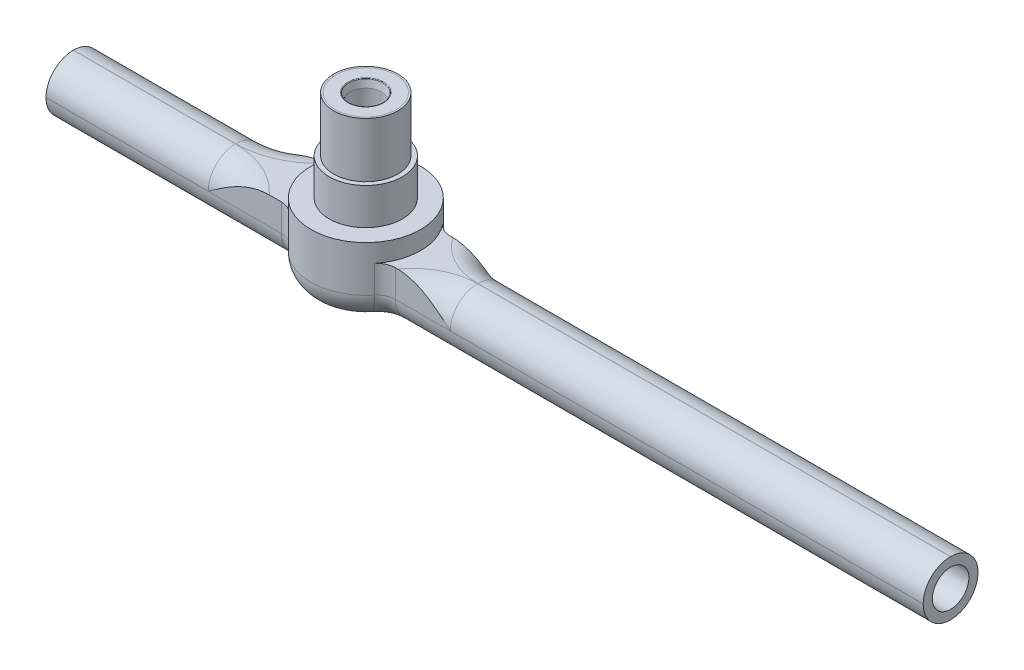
ISO-10303-21;
HEADER;
FILE_DESCRIPTION(('STEP AP214'),'2;1');
FILE_NAME('part.step','',(''),(''),'','','');
FILE_SCHEMA(('AUTOMOTIVE_DESIGN { 1 0 10303 214 1 1 1 1 }'));
ENDSEC;
DATA;
#1=APPLICATION_CONTEXT('core data for automotive mechanical design processes');
#2=APPLICATION_PROTOCOL_DEFINITION('international standard','automotive_design',2000,#1);
#3=PRODUCT_CONTEXT('',#1,'mechanical');
#4=PRODUCT('Part','Part','',(#3));
#5=PRODUCT_RELATED_PRODUCT_CATEGORY('part','',(#4));
#6=PRODUCT_DEFINITION_FORMATION('','',#4);
#7=PRODUCT_DEFINITION_CONTEXT('part definition',#1,'design');
#8=PRODUCT_DEFINITION('design','',#6,#7);
#9=PRODUCT_DEFINITION_SHAPE('','',#8);
#10=(LENGTH_UNIT() NAMED_UNIT(*) SI_UNIT(.MILLI.,.METRE.));
#11=(NAMED_UNIT(*) PLANE_ANGLE_UNIT() SI_UNIT($,.RADIAN.));
#12=(NAMED_UNIT(*) SI_UNIT($,.STERADIAN.) SOLID_ANGLE_UNIT());
#13=UNCERTAINTY_MEASURE_WITH_UNIT(LENGTH_MEASURE(1.E-05),#10,'distance_accuracy_value','');
#14=(GEOMETRIC_REPRESENTATION_CONTEXT(3) GLOBAL_UNCERTAINTY_ASSIGNED_CONTEXT((#13)) GLOBAL_UNIT_ASSIGNED_CONTEXT((#10,
#11,#12)) REPRESENTATION_CONTEXT('',''));
#15=CARTESIAN_POINT('',(0.,0.,0.));
#16=DIRECTION('',(0.,0.,1.));
#17=DIRECTION('',(1.,0.,0.));
#18=AXIS2_PLACEMENT_3D('',#15,#16,#17);
#19=CARTESIAN_POINT('',(-101.6,-57.15,19.05));
#20=DIRECTION('',(1.,0.,0.));
#21=DIRECTION('',(0.,1.,0.));
#22=AXIS2_PLACEMENT_3D('',#19,#20,#21);
#23=PLANE('',#22);
#24=CARTESIAN_POINT('',(-101.6,-47.5615,0.0634999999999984));
#25=DIRECTION('',(-1.,0.,0.));
#26=DIRECTION('',(0.,1.,0.));
#27=AXIS2_PLACEMENT_3D('',#24,#25,#26);
#28=CIRCLE('',#27,9.4615);
#29=CARTESIAN_POINT('',(-101.6,-47.5615,9.525));
#30=VERTEX_POINT('',#29);
#31=CARTESIAN_POINT('',(-101.6,-38.1,0.0635));
#32=VERTEX_POINT('',#31);
#33=EDGE_CURVE('E62',#30,#32,#28,.T.);
#34=ORIENTED_EDGE('',*,*,#33,.T.);
#35=DIRECTION('',(0.,0.,-1.));
#36=VECTOR('',#35,1.);
#37=CARTESIAN_POINT('',(-101.6,-38.1,19.05));
#38=LINE('',#37,#36);
#39=CARTESIAN_POINT('',(-101.6,-38.1,-0.0635));
#40=VERTEX_POINT('',#39);
#41=EDGE_CURVE('E339',#32,#40,#38,.T.);
#42=ORIENTED_EDGE('',*,*,#41,.T.);
#43=CARTESIAN_POINT('',(-101.6,-47.5615,-0.0634999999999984));
#44=DIRECTION('',(1.,0.,0.));
#45=DIRECTION('',(0.,1.,0.));
#46=AXIS2_PLACEMENT_3D('',#43,#44,#45);
#47=CIRCLE('',#46,9.4615);
#48=CARTESIAN_POINT('',(-101.6,-47.5615,-9.525));
#49=VERTEX_POINT('',#48);
#50=EDGE_CURVE('E272',#49,#40,#47,.T.);
#51=ORIENTED_EDGE('',*,*,#50,.F.);
#52=DIRECTION('',(0.,1.,0.));
#53=VECTOR('',#52,1.);
#54=CARTESIAN_POINT('',(-101.6,-57.15,-9.525));
#55=LINE('',#54,#53);
#56=CARTESIAN_POINT('',(-101.6,-47.625,-9.525));
#57=VERTEX_POINT('',#56);
#58=EDGE_CURVE('E315',#57,#49,#55,.T.);
#59=ORIENTED_EDGE('',*,*,#58,.F.);
#60=CARTESIAN_POINT('',(-101.6,-47.625,0.));
#61=DIRECTION('',(1.,0.,0.));
#62=DIRECTION('',(0.,1.,0.));
#63=AXIS2_PLACEMENT_3D('',#60,#61,#62);
#64=CIRCLE('',#63,9.525);
#65=CARTESIAN_POINT('',(-101.6,-57.15,0.));
#66=VERTEX_POINT('',#65);
#67=EDGE_CURVE('E401',#57,#66,#64,.F.);
#68=ORIENTED_EDGE('',*,*,#67,.T.);
#69=CARTESIAN_POINT('',(-101.6,-47.625,0.));
#70=DIRECTION('',(1.,0.,0.));
#71=DIRECTION('',(0.,1.,0.));
#72=AXIS2_PLACEMENT_3D('',#69,#70,#71);
#73=CIRCLE('',#72,9.525);
#74=CARTESIAN_POINT('',(-101.6,-47.625,9.525));
#75=VERTEX_POINT('',#74);
#76=EDGE_CURVE('E431',#66,#75,#73,.F.);
#77=ORIENTED_EDGE('',*,*,#76,.T.);
#78=DIRECTION('',(0.,1.,0.));
#79=VECTOR('',#78,1.);
#80=CARTESIAN_POINT('',(-101.6,-57.15,9.525));
#81=LINE('',#80,#79);
#82=EDGE_CURVE('E305',#75,#30,#81,.T.);
#83=ORIENTED_EDGE('',*,*,#82,.T.);
#84=EDGE_LOOP('',(#34,#42,#51,#59,#68,#77,#83));
#85=FACE_BOUND('',#84,.T.);
#86=CARTESIAN_POINT('',(-101.6,-47.625,0.));
#87=DIRECTION('',(-1.,0.,0.));
#88=DIRECTION('',(0.,0.,1.));
#89=AXIS2_PLACEMENT_3D('',#86,#87,#88);
#90=CIRCLE('',#89,6.34999999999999);
#91=CARTESIAN_POINT('',(-101.6,-47.625,6.34999999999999));
#92=VERTEX_POINT('',#91);
#93=EDGE_CURVE('E244',#92,#92,#90,.T.);
#94=ORIENTED_EDGE('',*,*,#93,.F.);
#95=EDGE_LOOP('',(#94));
#96=FACE_BOUND('',#95,.T.);
#97=ADVANCED_FACE('F42',(#85,#96),#23,.F.);
#98=CARTESIAN_POINT('',(-101.6,-38.1,19.05));
#99=DIRECTION('',(0.,-1.,0.));
#100=DIRECTION('',(0.,0.,-1.));
#101=AXIS2_PLACEMENT_3D('',#98,#99,#100);
#102=PLANE('',#101);
#103=CARTESIAN_POINT('',(-45.227868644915,-38.1,28.575));
#104=DIRECTION('',(0.,-1.,0.));
#105=DIRECTION('',(0.,0.,-1.));
#106=AXIS2_PLACEMENT_3D('',#103,#104,#105);
#107=CIRCLE('',#106,28.5115);
#108=CARTESIAN_POINT('',(-45.227868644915,-38.1,0.0634999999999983));
#109=VERTEX_POINT('',#108);
#110=CARTESIAN_POINT('',(-24.0145913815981,-38.1,9.52500000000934));
#111=VERTEX_POINT('',#110);
#112=EDGE_CURVE('E257',#109,#111,#107,.T.);
#113=ORIENTED_EDGE('',*,*,#112,.T.);
#114=DIRECTION('',(-1.,0.,0.));
#115=VECTOR('',#114,1.);
#116=CARTESIAN_POINT('',(-101.6,-38.1,9.525));
#117=LINE('',#116,#115);
#118=CARTESIAN_POINT('',(-19.827868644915,-38.1,9.525));
#119=VERTEX_POINT('',#118);
#120=EDGE_CURVE('E300',#119,#111,#117,.T.);
#121=ORIENTED_EDGE('',*,*,#120,.F.);
#122=CARTESIAN_POINT('',(-19.8278686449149,-38.1,15.875));
#123=DIRECTION('',(0.,-1.,0.));
#124=DIRECTION('',(0.,0.,-1.));
#125=AXIS2_PLACEMENT_3D('',#122,#123,#124);
#126=CIRCLE('',#125,6.35);
#127=CARTESIAN_POINT('',(-14.8709014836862,-38.1,11.90625));
#128=VERTEX_POINT('',#127);
#129=EDGE_CURVE('E370',#119,#128,#126,.T.);
#130=ORIENTED_EDGE('',*,*,#129,.T.);
#131=CARTESIAN_POINT('',(0.,-38.1,0.));
#132=DIRECTION('',(0.,1.,0.));
#133=DIRECTION('',(0.,0.,1.));
#134=AXIS2_PLACEMENT_3D('',#131,#132,#133);
#135=CIRCLE('',#134,19.05);
#136=CARTESIAN_POINT('',(-14.8709014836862,-38.1,-11.90625));
#137=VERTEX_POINT('',#136);
#138=EDGE_CURVE('E330',#137,#128,#135,.T.);
#139=ORIENTED_EDGE('',*,*,#138,.F.);
#140=CARTESIAN_POINT('',(-19.8278686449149,-38.1,-15.875));
#141=DIRECTION('',(0.,-1.,0.));
#142=DIRECTION('',(0.,0.,-1.));
#143=AXIS2_PLACEMENT_3D('',#140,#141,#142);
#144=CIRCLE('',#143,6.35);
#145=CARTESIAN_POINT('',(-19.827868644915,-38.1,-9.525));
#146=VERTEX_POINT('',#145);
#147=EDGE_CURVE('E367',#137,#146,#144,.T.);
#148=ORIENTED_EDGE('',*,*,#147,.T.);
#149=DIRECTION('',(1.,0.,0.));
#150=VECTOR('',#149,1.);
#151=CARTESIAN_POINT('',(-101.6,-38.1,-9.525));
#152=LINE('',#151,#150);
#153=CARTESIAN_POINT('',(-24.0145913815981,-38.1,-9.52500000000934));
#154=VERTEX_POINT('',#153);
#155=EDGE_CURVE('E308',#154,#146,#152,.T.);
#156=ORIENTED_EDGE('',*,*,#155,.F.);
#157=CARTESIAN_POINT('',(-45.227868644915,-38.1,-28.575));
#158=DIRECTION('',(0.,1.,0.));
#159=DIRECTION('',(0.,0.,1.));
#160=AXIS2_PLACEMENT_3D('',#157,#158,#159);
#161=CIRCLE('',#160,28.5115);
#162=CARTESIAN_POINT('',(-45.227868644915,-38.1,-0.0634999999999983));
#163=VERTEX_POINT('',#162);
#164=EDGE_CURVE('E281',#163,#154,#161,.T.);
#165=ORIENTED_EDGE('',*,*,#164,.F.);
#166=DIRECTION('',(-1.,0.,0.));
#167=VECTOR('',#166,1.);
#168=CARTESIAN_POINT('',(-45.227868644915,-38.1,-0.0634999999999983));
#169=LINE('',#168,#167);
#170=EDGE_CURVE('E276',#163,#40,#169,.T.);
#171=ORIENTED_EDGE('',*,*,#170,.T.);
#172=ORIENTED_EDGE('',*,*,#41,.F.);
#173=DIRECTION('',(-1.,0.,0.));
#174=VECTOR('',#173,1.);
#175=CARTESIAN_POINT('',(-45.227868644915,-38.1,0.0634999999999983));
#176=LINE('',#175,#174);
#177=EDGE_CURVE('E255',#109,#32,#176,.T.);
#178=ORIENTED_EDGE('',*,*,#177,.F.);
#179=EDGE_LOOP('',(#113,#121,#130,#139,#148,#156,#165,#171,#172,#178));
#180=FACE_BOUND('',#179,.T.);
#181=ADVANCED_FACE('F505',(#180),#102,.F.);
#182=CARTESIAN_POINT('',(19.05,-38.1,19.05));
#183=DIRECTION('',(0.,-1.,0.));
#184=DIRECTION('',(0.,0.,-1.));
#185=AXIS2_PLACEMENT_3D('',#182,#183,#184);
#186=PLANE('',#185);
#187=CARTESIAN_POINT('',(38.8778686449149,-38.1,-22.225));
#188=DIRECTION('',(0.,-1.,0.));
#189=DIRECTION('',(0.,0.,-1.));
#190=AXIS2_PLACEMENT_3D('',#187,#188,#189);
#191=CIRCLE('',#190,22.1615);
#192=CARTESIAN_POINT('',(38.8778686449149,-38.1,-0.0635000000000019));
#193=VERTEX_POINT('',#192);
#194=CARTESIAN_POINT('',(20.7163135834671,-38.1,-9.52499999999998));
#195=VERTEX_POINT('',#194);
#196=EDGE_CURVE('E268',#193,#195,#191,.T.);
#197=ORIENTED_EDGE('',*,*,#196,.T.);
#198=DIRECTION('',(1.,0.,0.));
#199=VECTOR('',#198,1.);
#200=CARTESIAN_POINT('',(203.2,-38.1,-9.525));
#201=LINE('',#200,#199);
#202=CARTESIAN_POINT('',(19.8278686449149,-38.1,-9.525));
#203=VERTEX_POINT('',#202);
#204=EDGE_CURVE('E312',#203,#195,#201,.T.);
#205=ORIENTED_EDGE('',*,*,#204,.F.);
#206=CARTESIAN_POINT('',(19.8278686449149,-38.1,-15.875));
#207=DIRECTION('',(0.,-1.,0.));
#208=DIRECTION('',(0.,0.,-1.));
#209=AXIS2_PLACEMENT_3D('',#206,#207,#208);
#210=CIRCLE('',#209,6.35);
#211=CARTESIAN_POINT('',(14.8709014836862,-38.1,-11.90625));
#212=VERTEX_POINT('',#211);
#213=EDGE_CURVE('E364',#203,#212,#210,.T.);
#214=ORIENTED_EDGE('',*,*,#213,.T.);
#215=CARTESIAN_POINT('',(14.8709014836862,-38.1,11.90625));
#216=VERTEX_POINT('',#215);
#217=EDGE_CURVE('E331',#216,#212,#135,.T.);
#218=ORIENTED_EDGE('',*,*,#217,.F.);
#219=CARTESIAN_POINT('',(19.8278686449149,-38.1,15.875));
#220=DIRECTION('',(0.,-1.,0.));
#221=DIRECTION('',(0.,0.,-1.));
#222=AXIS2_PLACEMENT_3D('',#219,#220,#221);
#223=CIRCLE('',#222,6.35);
#224=CARTESIAN_POINT('',(19.8278686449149,-38.1,9.525));
#225=VERTEX_POINT('',#224);
#226=EDGE_CURVE('E373',#216,#225,#223,.T.);
#227=ORIENTED_EDGE('',*,*,#226,.T.);
#228=DIRECTION('',(-1.,0.,0.));
#229=VECTOR('',#228,1.);
#230=CARTESIAN_POINT('',(203.2,-38.1,9.525));
#231=LINE('',#230,#229);
#232=CARTESIAN_POINT('',(20.7163135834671,-38.1,9.52499999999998));
#233=VERTEX_POINT('',#232);
#234=EDGE_CURVE('E298',#233,#225,#231,.T.);
#235=ORIENTED_EDGE('',*,*,#234,.F.);
#236=CARTESIAN_POINT('',(38.8778686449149,-38.1,22.225));
#237=DIRECTION('',(0.,1.,0.));
#238=DIRECTION('',(0.,0.,1.));
#239=AXIS2_PLACEMENT_3D('',#236,#237,#238);
#240=CIRCLE('',#239,22.1615);
#241=CARTESIAN_POINT('',(38.8778686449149,-38.1,0.0635000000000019));
#242=VERTEX_POINT('',#241);
#243=EDGE_CURVE('E293',#242,#233,#240,.T.);
#244=ORIENTED_EDGE('',*,*,#243,.F.);
#245=DIRECTION('',(1.,0.,0.));
#246=VECTOR('',#245,1.);
#247=CARTESIAN_POINT('',(38.8778686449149,-38.1,0.0635000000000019));
#248=LINE('',#247,#246);
#249=CARTESIAN_POINT('',(203.2,-38.1,0.0635000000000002));
#250=VERTEX_POINT('',#249);
#251=EDGE_CURVE('E289',#242,#250,#248,.T.);
#252=ORIENTED_EDGE('',*,*,#251,.T.);
#253=DIRECTION('',(0.,0.,-1.));
#254=VECTOR('',#253,1.);
#255=CARTESIAN_POINT('',(203.2,-38.1,19.05));
#256=LINE('',#255,#254);
#257=CARTESIAN_POINT('',(203.2,-38.1,-0.0635000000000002));
#258=VERTEX_POINT('',#257);
#259=EDGE_CURVE('E341',#250,#258,#256,.T.);
#260=ORIENTED_EDGE('',*,*,#259,.T.);
#261=DIRECTION('',(1.,0.,0.));
#262=VECTOR('',#261,1.);
#263=CARTESIAN_POINT('',(38.8778686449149,-38.1,-0.0635000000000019));
#264=LINE('',#263,#262);
#265=EDGE_CURVE('E266',#193,#258,#264,.T.);
#266=ORIENTED_EDGE('',*,*,#265,.F.);
#267=EDGE_LOOP('',(#197,#205,#214,#218,#227,#235,#244,#252,#260,#266));
#268=FACE_BOUND('',#267,.T.);
#269=ADVANCED_FACE('F511',(#268),#186,.F.);
#270=CARTESIAN_POINT('',(203.2,-38.1,19.05));
#271=DIRECTION('',(-1.,0.,0.));
#272=DIRECTION('',(0.,0.,1.));
#273=AXIS2_PLACEMENT_3D('',#270,#271,#272);
#274=PLANE('',#273);
#275=CARTESIAN_POINT('',(203.2,-47.625,0.));
#276=DIRECTION('',(1.,0.,0.));
#277=DIRECTION('',(0.,0.,-1.));
#278=AXIS2_PLACEMENT_3D('',#275,#276,#277);
#279=CIRCLE('',#278,6.34999999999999);
#280=CARTESIAN_POINT('',(203.2,-47.625,-6.34999999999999));
#281=VERTEX_POINT('',#280);
#282=EDGE_CURVE('E247',#281,#281,#279,.T.);
#283=ORIENTED_EDGE('',*,*,#282,.F.);
#284=EDGE_LOOP('',(#283));
#285=FACE_BOUND('',#284,.T.);
#286=CARTESIAN_POINT('',(203.2,-47.5615,-0.0634999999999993));
#287=DIRECTION('',(1.,0.,0.));
#288=DIRECTION('',(0.,0.,-1.));
#289=AXIS2_PLACEMENT_3D('',#286,#287,#288);
#290=CIRCLE('',#289,9.4615);
#291=CARTESIAN_POINT('',(203.2,-47.5615,-9.525));
#292=VERTEX_POINT('',#291);
#293=EDGE_CURVE('E70',#292,#258,#290,.T.);
#294=ORIENTED_EDGE('',*,*,#293,.T.);
#295=ORIENTED_EDGE('',*,*,#259,.F.);
#296=CARTESIAN_POINT('',(203.2,-47.5615,0.0634999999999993));
#297=DIRECTION('',(-1.,0.,0.));
#298=DIRECTION('',(0.,0.,1.));
#299=AXIS2_PLACEMENT_3D('',#296,#297,#298);
#300=CIRCLE('',#299,9.4615);
#301=CARTESIAN_POINT('',(203.2,-47.5615,9.525));
#302=VERTEX_POINT('',#301);
#303=EDGE_CURVE('E285',#302,#250,#300,.T.);
#304=ORIENTED_EDGE('',*,*,#303,.F.);
#305=DIRECTION('',(0.,1.,0.));
#306=VECTOR('',#305,1.);
#307=CARTESIAN_POINT('',(203.2,-57.15,9.525));
#308=LINE('',#307,#306);
#309=CARTESIAN_POINT('',(203.2,-47.625,9.525));
#310=VERTEX_POINT('',#309);
#311=EDGE_CURVE('E304',#310,#302,#308,.T.);
#312=ORIENTED_EDGE('',*,*,#311,.F.);
#313=CARTESIAN_POINT('',(203.2,-47.625,0.));
#314=DIRECTION('',(-1.,0.,0.));
#315=DIRECTION('',(0.,0.,1.));
#316=AXIS2_PLACEMENT_3D('',#313,#314,#315);
#317=CIRCLE('',#316,9.525);
#318=CARTESIAN_POINT('',(203.2,-57.15,0.));
#319=VERTEX_POINT('',#318);
#320=EDGE_CURVE('E423',#310,#319,#317,.F.);
#321=ORIENTED_EDGE('',*,*,#320,.T.);
#322=CARTESIAN_POINT('',(203.2,-47.625,0.));
#323=DIRECTION('',(-1.,0.,0.));
#324=DIRECTION('',(0.,0.,1.));
#325=AXIS2_PLACEMENT_3D('',#322,#323,#324);
#326=CIRCLE('',#325,9.525);
#327=CARTESIAN_POINT('',(203.2,-47.625,-9.525));
#328=VERTEX_POINT('',#327);
#329=EDGE_CURVE('E389',#319,#328,#326,.F.);
#330=ORIENTED_EDGE('',*,*,#329,.T.);
#331=DIRECTION('',(0.,1.,0.));
#332=VECTOR('',#331,1.);
#333=CARTESIAN_POINT('',(203.2,-57.15,-9.525));
#334=LINE('',#333,#332);
#335=EDGE_CURVE('E316',#328,#292,#334,.T.);
#336=ORIENTED_EDGE('',*,*,#335,.T.);
#337=EDGE_LOOP('',(#294,#295,#304,#312,#321,#330,#336));
#338=FACE_BOUND('',#337,.T.);
#339=ADVANCED_FACE('F524',(#285,#338),#274,.F.);
#340=CARTESIAN_POINT('',(-101.6,-57.15,-9.525));
#341=DIRECTION('',(0.,0.,1.));
#342=DIRECTION('',(1.,0.,0.));
#343=AXIS2_PLACEMENT_3D('',#340,#341,#342);
#344=PLANE('',#343);
#345=CARTESIAN_POINT('',(-45.227868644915,-47.5615,-9.525));
#346=CARTESIAN_POINT('',(-45.227868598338,-47.5617669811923,-9.525));
#347=CARTESIAN_POINT('',(-45.227238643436,-47.5620339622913,-9.525));
#348=CARTESIAN_POINT('',(-45.2258904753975,-47.5627450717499,-9.525));
#349=CARTESIAN_POINT('',(-45.2253909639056,-47.5631892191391,-9.525));
#350=CARTESIAN_POINT('',(-45.2233727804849,-47.5648234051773,-9.525));
#351=CARTESIAN_POINT('',(-45.2215517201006,-47.5660130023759,-9.525));
#352=CARTESIAN_POINT('',(-45.2147056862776,-47.5706017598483,-9.525));
#353=CARTESIAN_POINT('',(-45.2100108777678,-47.5740018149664,-9.525));
#354=CARTESIAN_POINT('',(-45.120867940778,-47.6384039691,-9.525));
#355=CARTESIAN_POINT('',(-45.032771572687,-47.699395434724,-9.525));
#356=CARTESIAN_POINT('',(-44.8575853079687,-47.822016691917,-9.525));
#357=CARTESIAN_POINT('',(-44.7705162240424,-47.8836463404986,-9.525));
#358=CARTESIAN_POINT('',(-44.5952167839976,-48.0072936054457,-9.525));
#359=CARTESIAN_POINT('',(-44.5069825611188,-48.0693109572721,-9.525));
#360=CARTESIAN_POINT('',(-44.3308679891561,-48.1931140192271,-9.525));
#361=CARTESIAN_POINT('',(-44.242987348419,-48.2548998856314,-9.525));
#362=CARTESIAN_POINT('',(-43.9777621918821,-48.4411791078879,-9.525));
#363=CARTESIAN_POINT('',(-43.800299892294,-48.5655605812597,-9.525));
#364=CARTESIAN_POINT('',(-43.4456037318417,-48.8135217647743,-9.525));
#365=CARTESIAN_POINT('',(-43.2683706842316,-48.9371027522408,-9.525));
#366=CARTESIAN_POINT('',(-42.918927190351,-49.1798953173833,-9.525));
#367=CARTESIAN_POINT('',(-42.7467293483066,-49.2991246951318,-9.525));
#368=CARTESIAN_POINT('',(-42.4017273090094,-49.5369843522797,-9.525));
#369=CARTESIAN_POINT('',(-42.2289227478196,-49.6556141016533,-9.525));
#370=CARTESIAN_POINT('',(-41.7107976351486,-50.0094815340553,-9.525));
#371=CARTESIAN_POINT('',(-41.3646327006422,-50.2434871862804,-9.525));
#372=CARTESIAN_POINT('',(-40.6376544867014,-50.7282225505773,-9.525));
#373=CARTESIAN_POINT('',(-40.2565599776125,-50.9785316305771,-9.525));
#374=CARTESIAN_POINT('',(-39.4896812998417,-51.4725860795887,-9.525));
#375=CARTESIAN_POINT('',(-39.1038935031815,-51.7163258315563,-9.525));
#376=CARTESIAN_POINT('',(-38.3242304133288,-52.1972205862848,-9.525));
#377=CARTESIAN_POINT('',(-37.9303162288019,-52.4343127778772,-9.525));
#378=CARTESIAN_POINT('',(-37.1365987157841,-52.8981964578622,-9.525));
#379=CARTESIAN_POINT('',(-36.7367968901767,-53.1249905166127,-9.525));
#380=CARTESIAN_POINT('',(-35.6969566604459,-53.6944311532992,-9.525));
#381=CARTESIAN_POINT('',(-35.0519274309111,-54.0280754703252,-9.525));
#382=CARTESIAN_POINT('',(-33.7445894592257,-54.6567533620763,-9.525));
#383=CARTESIAN_POINT('',(-33.0823140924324,-54.95185570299,-9.525));
#384=CARTESIAN_POINT('',(-31.751893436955,-55.4899115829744,-9.525));
#385=CARTESIAN_POINT('',(-31.0841206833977,-55.7337777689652,-9.525));
#386=CARTESIAN_POINT('',(-29.7310135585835,-56.1671243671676,-9.525));
#387=CARTESIAN_POINT('',(-29.0456844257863,-56.356620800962,-9.525));
#388=CARTESIAN_POINT('',(-27.91388444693,-56.6133366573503,-9.525));
#389=CARTESIAN_POINT('',(-27.471776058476,-56.6999264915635,-9.525));
#390=CARTESIAN_POINT('',(-26.5814711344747,-56.8444573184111,-9.525));
#391=CARTESIAN_POINT('',(-26.1332604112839,-56.9023124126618,-9.525));
#392=CARTESIAN_POINT('',(-25.2196655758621,-56.9873067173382,-9.525));
#393=CARTESIAN_POINT('',(-24.7541842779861,-57.013423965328,-9.525));
#394=CARTESIAN_POINT('',(-23.8229615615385,-57.0282090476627,-9.525));
#395=CARTESIAN_POINT('',(-23.3572208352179,-57.0169132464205,-9.525));
#396=CARTESIAN_POINT('',(-22.5151224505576,-56.959522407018,-9.525));
#397=CARTESIAN_POINT('',(-22.1382939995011,-56.9203101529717,-9.525));
#398=CARTESIAN_POINT('',(-21.3887459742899,-56.8132252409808,-9.525));
#399=CARTESIAN_POINT('',(-21.0160255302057,-56.7453587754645,-9.525));
#400=CARTESIAN_POINT('',(-20.280420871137,-56.5800596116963,-9.525));
#401=CARTESIAN_POINT('',(-19.9174805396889,-56.4828782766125,-9.525));
#402=CARTESIAN_POINT('',(-19.2013958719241,-56.2574181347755,-9.525));
#403=CARTESIAN_POINT('',(-18.8482490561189,-56.1291472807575,-9.525));
#404=CARTESIAN_POINT('',(-18.2236988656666,-55.8689848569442,-9.525));
#405=CARTESIAN_POINT('',(-17.949912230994,-55.7427986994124,-9.525));
#406=CARTESIAN_POINT('',(-17.4130531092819,-55.4694298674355,-9.525));
#407=CARTESIAN_POINT('',(-17.1499783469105,-55.3222516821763,-9.525));
#408=CARTESIAN_POINT('',(-16.636338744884,-55.0065243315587,-9.525));
#409=CARTESIAN_POINT('',(-16.3857955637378,-54.8379398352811,-9.525));
#410=CARTESIAN_POINT('',(-15.9001362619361,-54.4797841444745,-9.525));
#411=CARTESIAN_POINT('',(-15.6650204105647,-54.2902125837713,-9.525));
#412=CARTESIAN_POINT('',(-15.2111449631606,-53.8891587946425,-9.525));
#413=CARTESIAN_POINT('',(-14.9925179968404,-53.6775260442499,-9.525));
#414=CARTESIAN_POINT('',(-14.5762583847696,-53.2344705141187,-9.525));
#415=CARTESIAN_POINT('',(-14.3786264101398,-53.003047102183,-9.525));
#416=CARTESIAN_POINT('',(-14.0072534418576,-52.5220611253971,-9.525));
#417=CARTESIAN_POINT('',(-13.8334910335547,-52.2725151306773,-9.525));
#418=CARTESIAN_POINT('',(-13.5122818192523,-51.757029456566,-9.525));
#419=CARTESIAN_POINT('',(-13.3648301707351,-51.4910928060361,-9.525));
#420=CARTESIAN_POINT('',(-13.1168751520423,-50.9826723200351,-9.525));
#421=CARTESIAN_POINT('',(-13.0127069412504,-50.7419701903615,-9.525));
#422=CARTESIAN_POINT('',(-12.827065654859,-50.2519713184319,-9.525));
#423=CARTESIAN_POINT('',(-12.745589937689,-50.0026755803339,-9.525));
#424=CARTESIAN_POINT('',(-12.6064643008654,-49.4976625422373,-9.525));
#425=CARTESIAN_POINT('',(-12.5488014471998,-49.241948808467,-9.525));
#426=CARTESIAN_POINT('',(-12.4580446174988,-48.726198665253,-9.525));
#427=CARTESIAN_POINT('',(-12.424948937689,-48.4661625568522,-9.525));
#428=CARTESIAN_POINT('',(-12.3858279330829,-47.9699778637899,-9.525));
#429=CARTESIAN_POINT('',(-12.3774477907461,-47.7340119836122,-9.525));
#430=CARTESIAN_POINT('',(-12.3811020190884,-47.2622431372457,-9.525));
#431=CARTESIAN_POINT('',(-12.393135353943,-47.0264401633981,-9.525));
#432=CARTESIAN_POINT('',(-12.4374707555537,-46.5568045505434,-9.525));
#433=CARTESIAN_POINT('',(-12.4697683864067,-46.3229714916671,-9.525));
#434=CARTESIAN_POINT('',(-12.5542551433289,-45.8589278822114,-9.525));
#435=CARTESIAN_POINT('',(-12.6064444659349,-45.6287173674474,-9.525));
#436=CARTESIAN_POINT('',(-12.728829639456,-45.1783064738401,-9.525));
#437=CARTESIAN_POINT('',(-12.7986266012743,-44.9579974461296,-9.525));
#438=CARTESIAN_POINT('',(-12.9560180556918,-44.5237403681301,-9.525));
#439=CARTESIAN_POINT('',(-13.0436195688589,-44.3097948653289,-9.525));
#440=CARTESIAN_POINT('',(-13.2357214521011,-43.8896266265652,-9.525));
#441=CARTESIAN_POINT('',(-13.3402227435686,-43.6834043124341,-9.525));
#442=CARTESIAN_POINT('',(-13.5650726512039,-43.2798931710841,-9.525));
#443=CARTESIAN_POINT('',(-13.6854159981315,-43.0826014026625,-9.525));
#444=CARTESIAN_POINT('',(-13.9470200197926,-42.6885981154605,-9.525));
#445=CARTESIAN_POINT('',(-14.0890076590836,-42.4923694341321,-9.525));
#446=CARTESIAN_POINT('',(-14.3878822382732,-42.1116233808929,-9.525));
#447=CARTESIAN_POINT('',(-14.5447695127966,-41.9271062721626,-9.525));
#448=CARTESIAN_POINT('',(-14.8720762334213,-41.5705034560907,-9.525));
#449=CARTESIAN_POINT('',(-15.0424959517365,-41.3984179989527,-9.525));
#450=CARTESIAN_POINT('',(-15.3955022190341,-41.0672065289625,-9.525));
#451=CARTESIAN_POINT('',(-15.5780900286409,-40.9080818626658,-9.525));
#452=CARTESIAN_POINT('',(-15.9740360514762,-40.5869818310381,-9.525));
#453=CARTESIAN_POINT('',(-16.188603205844,-40.4264967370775,-9.525));
#454=CARTESIAN_POINT('',(-16.6291850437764,-40.1221282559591,-9.525));
#455=CARTESIAN_POINT('',(-16.8552002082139,-39.9782455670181,-9.525));
#456=CARTESIAN_POINT('',(-17.3172472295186,-39.7070088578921,-9.525));
#457=CARTESIAN_POINT('',(-17.5532894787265,-39.5796725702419,-9.525));
#458=CARTESIAN_POINT('',(-18.0336098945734,-39.3415946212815,-9.525));
#459=CARTESIAN_POINT('',(-18.277889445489,-39.2308557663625,-9.525));
#460=CARTESIAN_POINT('',(-18.8777940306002,-38.982449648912,-9.525));
#461=CARTESIAN_POINT('',(-19.236903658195,-38.8531400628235,-9.525));
#462=CARTESIAN_POINT('',(-19.9651007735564,-38.6265445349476,-9.525));
#463=CARTESIAN_POINT('',(-20.3341914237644,-38.5292688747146,-9.525));
#464=CARTESIAN_POINT('',(-21.078375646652,-38.3654940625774,-9.525));
#465=CARTESIAN_POINT('',(-21.4534567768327,-38.2989380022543,-9.525));
#466=CARTESIAN_POINT('',(-22.2075345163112,-38.1947009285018,-9.525));
#467=CARTESIAN_POINT('',(-22.5865311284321,-38.1570199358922,-9.525));
#468=CARTESIAN_POINT('',(-23.4804945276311,-38.1002395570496,-9.525));
#469=CARTESIAN_POINT('',(-23.9961909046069,-38.0924091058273,-9.525));
#470=CARTESIAN_POINT('',(-25.0263351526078,-38.1218767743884,-9.525));
#471=CARTESIAN_POINT('',(-25.540782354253,-38.1591952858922,-9.525));
#472=CARTESIAN_POINT('',(-26.573084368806,-38.2753568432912,-9.525));
#473=CARTESIAN_POINT('',(-27.0908654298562,-38.3548440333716,-9.525));
#474=CARTESIAN_POINT('',(-28.1189760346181,-38.5510827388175,-9.525));
#475=CARTESIAN_POINT('',(-28.6293082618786,-38.6678204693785,-9.525));
#476=CARTESIAN_POINT('',(-29.9858860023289,-39.0249798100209,-9.525));
#477=CARTESIAN_POINT('',(-30.8242569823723,-39.2954957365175,-9.525));
#478=CARTESIAN_POINT('',(-32.4746004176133,-39.9114011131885,-9.525));
#479=CARTESIAN_POINT('',(-33.2865035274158,-40.2569715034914,-9.525));
#480=CARTESIAN_POINT('',(-34.8361042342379,-40.9842686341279,-9.525));
#481=CARTESIAN_POINT('',(-35.5753654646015,-41.3627018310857,-9.525));
#482=CARTESIAN_POINT('',(-36.6655355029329,-41.9586496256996,-9.525));
#483=CARTESIAN_POINT('',(-37.0246989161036,-42.1613302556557,-9.525));
#484=CARTESIAN_POINT('',(-37.7382012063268,-42.5751555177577,-9.525));
#485=CARTESIAN_POINT('',(-38.0925393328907,-42.7863014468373,-9.525));
#486=CARTESIAN_POINT('',(-38.7021652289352,-43.1580241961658,-9.525));
#487=CARTESIAN_POINT('',(-38.9584733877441,-43.3169364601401,-9.525));
#488=CARTESIAN_POINT('',(-39.4688378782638,-43.6380317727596,-9.525));
#489=CARTESIAN_POINT('',(-39.7228953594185,-43.8002129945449,-9.525));
#490=CARTESIAN_POINT('',(-40.2338628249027,-44.1305316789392,-9.525));
#491=CARTESIAN_POINT('',(-40.4907374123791,-44.2987238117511,-9.525));
#492=CARTESIAN_POINT('',(-41.00328516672,-44.6379728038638,-9.525));
#493=CARTESIAN_POINT('',(-41.2589551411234,-44.8090344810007,-9.525));
#494=CARTESIAN_POINT('',(-41.8371583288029,-45.1993534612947,-9.525));
#495=CARTESIAN_POINT('',(-42.1592603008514,-45.4192486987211,-9.525));
#496=CARTESIAN_POINT('',(-42.6399781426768,-45.7501531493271,-9.525));
#497=CARTESIAN_POINT('',(-42.7992365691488,-45.8602292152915,-9.525));
#498=CARTESIAN_POINT('',(-43.1172716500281,-46.0807971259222,-9.525));
#499=CARTESIAN_POINT('',(-43.276048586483,-46.1912885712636,-9.525));
#500=CARTESIAN_POINT('',(-43.5802910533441,-46.4035553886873,-9.525));
#501=CARTESIAN_POINT('',(-43.7257764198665,-46.5052995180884,-9.525));
#502=CARTESIAN_POINT('',(-44.0169054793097,-46.709332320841,-9.525));
#503=CARTESIAN_POINT('',(-44.1625484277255,-46.8116217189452,-9.525));
#504=CARTESIAN_POINT('',(-44.4587684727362,-47.0197041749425,-9.525));
#505=CARTESIAN_POINT('',(-44.6093518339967,-47.1255028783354,-9.525));
#506=CARTESIAN_POINT('',(-44.8338599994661,-47.2839864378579,-9.525));
#507=CARTESIAN_POINT('',(-44.9082668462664,-47.3366350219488,-9.525));
#508=CARTESIAN_POINT('',(-45.0579257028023,-47.4413855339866,-9.525));
#509=CARTESIAN_POINT('',(-45.1331605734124,-47.4934873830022,-9.525));
#510=CARTESIAN_POINT('',(-45.2100105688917,-47.5489972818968,-9.525));
#511=CARTESIAN_POINT('',(-45.2147032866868,-47.5523964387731,-9.525));
#512=CARTESIAN_POINT('',(-45.221548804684,-47.5569849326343,-9.525));
#513=CARTESIAN_POINT('',(-45.223370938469,-47.5581751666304,-9.525));
#514=CARTESIAN_POINT('',(-45.2253900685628,-47.5598101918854,-9.525));
#515=CARTESIAN_POINT('',(-45.2258897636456,-47.5602545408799,-9.525));
#516=CARTESIAN_POINT('',(-45.2272385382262,-47.5609659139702,-9.525));
#517=CARTESIAN_POINT('',(-45.2278686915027,-47.5612329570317,-9.525));
#518=CARTESIAN_POINT('',(-45.227868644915,-47.5615,-9.525));
#519=B_SPLINE_CURVE_WITH_KNOTS('',3,(#345,#346,#347,#348,#349,#350,#351,#352,#353,#354,#355,
#356,#357,#358,#359,#360,#361,#362,#363,#364,#365,#366,#367,#368,#369,#370,#371,#372,#373,#374,
#375,#376,#377,#378,#379,#380,#381,#382,#383,#384,#385,#386,#387,#388,#389,#390,#391,#392,#393,
#394,#395,#396,#397,#398,#399,#400,#401,#402,#403,#404,#405,#406,#407,#408,#409,#410,#411,#412,
#413,#414,#415,#416,#417,#418,#419,#420,#421,#422,#423,#424,#425,#426,#427,#428,#429,#430,#431,
#432,#433,#434,#435,#436,#437,#438,#439,#440,#441,#442,#443,#444,#445,#446,#447,#448,#449,#450,
#451,#452,#453,#454,#455,#456,#457,#458,#459,#460,#461,#462,#463,#464,#465,#466,#467,#468,#469,
#470,#471,#472,#473,#474,#475,#476,#477,#478,#479,#480,#481,#482,#483,#484,#485,#486,#487,#488,
#489,#490,#491,#492,#493,#494,#495,#496,#497,#498,#499,#500,#501,#502,#503,#504,#505,#506,#507,
#508,#509,#510,#511,#512,#513,#514,#515,#516,#517,#518),.UNSPECIFIED.,.T.,.F.,(4,2,2,2,2,2,2,2,
2,2,2,2,2,2,2,2,2,2,2,2,2,2,2,2,2,2,2,2,2,2,2,2,2,2,2,2,2,2,2,2,2,2,2,2,2,2,2,2,2,2,2,2,2,2,2,2,
2,2,2,2,2,2,2,2,2,2,2,2,2,2,2,2,2,2,2,2,2,2,2,2,2,2,2,2,2,2,4),(0.,0.00139012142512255,
0.00370246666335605,0.00989948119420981,0.0276043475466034,0.345259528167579,0.666308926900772,
0.989578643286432,1.31192659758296,1.96200490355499,2.61021162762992,3.23854524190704,
3.86736109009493,5.12084971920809,6.48863421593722,7.8575533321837,9.23670124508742,
10.6155030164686,12.7931023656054,14.9667617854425,17.0976086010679,19.2278268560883,
20.5785421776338,21.9332713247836,23.330556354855,24.7264836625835,25.8620765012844,
26.9974240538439,28.1233005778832,29.2488894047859,30.1524450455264,31.0558077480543,
31.960681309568,32.8655706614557,33.777097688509,34.6886538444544,35.5993867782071,
36.5099519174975,37.2957074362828,38.0813714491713,38.8666081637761,39.6517904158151,
40.35926935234,41.0667123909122,41.774000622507,42.4812958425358,43.173817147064,
43.8666120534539,44.5594447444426,45.2520475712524,45.9779104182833,46.7037895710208,
47.4296833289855,48.1556524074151,48.9586803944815,49.7617421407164,50.5656575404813,
51.3697087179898,52.5130773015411,53.6568125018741,54.7984203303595,55.9400289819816,
57.4849851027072,59.0306392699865,60.6006141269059,62.1700086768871,64.8079830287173,
67.452388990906,69.9422433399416,71.1793722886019,72.4166915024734,73.3213895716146,
74.2255953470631,75.1466957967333,76.0695389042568,77.2395374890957,77.8203261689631,
78.4006538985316,78.9332093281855,79.467293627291,80.0187662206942,80.2930083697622,
80.5643639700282,80.5820641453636,80.5882644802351,80.590577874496,80.5919683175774),.UNSPECIFIED.);
#520=CARTESIAN_POINT('',(-45.2278686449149,-47.5615,-9.525));
#521=VERTEX_POINT('',#520);
#522=EDGE_CURVE('E452',#154,#521,#519,.T.);
#523=ORIENTED_EDGE('',*,*,#522,.F.);
#524=ORIENTED_EDGE('',*,*,#155,.T.);
#525=DIRECTION('',(0.,1.,0.));
#526=VECTOR('',#525,1.);
#527=CARTESIAN_POINT('',(-19.8278686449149,-57.15,-9.525));
#528=LINE('',#527,#526);
#529=CARTESIAN_POINT('',(-19.8278686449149,-47.625,-9.525));
#530=VERTEX_POINT('',#529);
#531=EDGE_CURVE('E356',#146,#530,#528,.F.);
#532=ORIENTED_EDGE('',*,*,#531,.T.);
#533=DIRECTION('',(1.,0.,0.));
#534=VECTOR('',#533,1.);
#535=CARTESIAN_POINT('',(-101.6,-47.625,-9.525));
#536=LINE('',#535,#534);
#537=EDGE_CURVE('E399',#530,#57,#536,.F.);
#538=ORIENTED_EDGE('',*,*,#537,.T.);
#539=ORIENTED_EDGE('',*,*,#58,.T.);
#540=DIRECTION('',(-1.,0.,0.));
#541=VECTOR('',#540,1.);
#542=CARTESIAN_POINT('',(-45.2278686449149,-47.5615,-9.525));
#543=LINE('',#542,#541);
#544=EDGE_CURVE('E279',#521,#49,#543,.T.);
#545=ORIENTED_EDGE('',*,*,#544,.F.);
#546=EDGE_LOOP('',(#523,#524,#532,#538,#539,#545));
#547=FACE_BOUND('',#546,.T.);
#548=ADVANCED_FACE('F466',(#547),#344,.F.);
#549=CARTESIAN_POINT('',(203.2,-57.15,9.525));
#550=DIRECTION('',(0.,0.,-1.));
#551=DIRECTION('',(-1.,0.,0.));
#552=AXIS2_PLACEMENT_3D('',#549,#550,#551);
#553=PLANE('',#552);
#554=CARTESIAN_POINT('',(38.8778686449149,-47.5615,9.525));
#555=CARTESIAN_POINT('',(38.872181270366,-47.5565910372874,9.525));
#556=CARTESIAN_POINT('',(38.8664938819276,-47.551682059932,9.525));
#557=CARTESIAN_POINT('',(37.5070120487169,-46.3782685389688,9.52499999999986));
#558=CARTESIAN_POINT('',(36.1522237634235,-45.209199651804,9.52499999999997));
#559=CARTESIAN_POINT('',(34.0452310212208,-43.5499064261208,9.52500000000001));
#560=CARTESIAN_POINT('',(33.3307250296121,-43.0127182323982,9.525));
#561=CARTESIAN_POINT('',(31.8668453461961,-41.9879722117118,9.52499999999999));
#562=CARTESIAN_POINT('',(31.1174915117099,-41.5003866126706,9.525));
#563=CARTESIAN_POINT('',(29.8973290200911,-40.7835876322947,9.525));
#564=CARTESIAN_POINT('',(29.4401514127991,-40.5311966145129,9.525));
#565=CARTESIAN_POINT('',(28.511142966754,-40.0551432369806,9.525));
#566=CARTESIAN_POINT('',(28.0393169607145,-39.8314715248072,9.525));
#567=CARTESIAN_POINT('',(27.0811549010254,-39.4178078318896,9.525));
#568=CARTESIAN_POINT('',(26.5948221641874,-39.2278082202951,9.525));
#569=CARTESIAN_POINT('',(25.6086596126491,-38.8867543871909,9.525));
#570=CARTESIAN_POINT('',(25.1088333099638,-38.7356901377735,9.525));
#571=CARTESIAN_POINT('',(24.2034896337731,-38.5049147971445,9.525));
#572=CARTESIAN_POINT('',(23.8000898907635,-38.4168898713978,9.525));
#573=CARTESIAN_POINT('',(22.9878371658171,-38.2713939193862,9.525));
#574=CARTESIAN_POINT('',(22.5789854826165,-38.2139157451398,9.525));
#575=CARTESIAN_POINT('',(21.7582687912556,-38.1322403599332,9.525));
#576=CARTESIAN_POINT('',(21.346406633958,-38.1080149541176,9.525));
#577=CARTESIAN_POINT('',(20.5221148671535,-38.0953436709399,9.525));
#578=CARTESIAN_POINT('',(20.1096853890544,-38.1068905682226,9.525));
#579=CARTESIAN_POINT('',(19.3670055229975,-38.1621696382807,9.525));
#580=CARTESIAN_POINT('',(19.0362546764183,-38.1992611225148,9.525));
#581=CARTESIAN_POINT('',(18.3787081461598,-38.2992965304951,9.525));
#582=CARTESIAN_POINT('',(18.0519116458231,-38.3622350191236,9.525));
#583=CARTESIAN_POINT('',(17.4045110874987,-38.5148319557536,9.525));
#584=CARTESIAN_POINT('',(17.0839083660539,-38.6044961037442,9.525));
#585=CARTESIAN_POINT('',(16.4515806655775,-38.8111264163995,9.525));
#586=CARTESIAN_POINT('',(16.1398558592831,-38.928093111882,9.525));
#587=CARTESIAN_POINT('',(15.5258201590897,-39.1905906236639,9.525));
#588=CARTESIAN_POINT('',(15.223598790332,-39.3363317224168,9.525));
#589=CARTESIAN_POINT('',(14.6342122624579,-39.655670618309,9.525));
#590=CARTESIAN_POINT('',(14.3470476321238,-39.8292693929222,9.525));
#591=CARTESIAN_POINT('',(13.7911891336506,-40.2036755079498,9.525));
#592=CARTESIAN_POINT('',(13.5224830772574,-40.4044646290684,9.525));
#593=CARTESIAN_POINT('',(13.1358042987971,-40.72514941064,9.525));
#594=CARTESIAN_POINT('',(13.0096421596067,-40.8352937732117,9.525));
#595=CARTESIAN_POINT('',(12.7631020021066,-41.0619610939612,9.525));
#596=CARTESIAN_POINT('',(12.6427259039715,-41.1784861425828,9.525));
#597=CARTESIAN_POINT('',(12.3220563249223,-41.5055581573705,9.525));
#598=CARTESIAN_POINT('',(12.1280074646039,-41.7222983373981,9.525));
#599=CARTESIAN_POINT('',(11.7608737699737,-42.172787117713,9.525));
#600=CARTESIAN_POINT('',(11.5877857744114,-42.4065331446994,9.525));
#601=CARTESIAN_POINT('',(11.2646171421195,-42.8891856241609,9.525));
#602=CARTESIAN_POINT('',(11.1145187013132,-43.1380801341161,9.525));
#603=CARTESIAN_POINT('',(10.8389839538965,-43.6491638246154,9.525));
#604=CARTESIAN_POINT('',(10.7135455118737,-43.9113518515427,9.525));
#605=CARTESIAN_POINT('',(10.5008608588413,-44.4181820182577,9.525));
#606=CARTESIAN_POINT('',(10.4109694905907,-44.6617175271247,9.525));
#607=CARTESIAN_POINT('',(10.2530308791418,-45.1557506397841,9.525));
#608=CARTESIAN_POINT('',(10.1849806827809,-45.4062472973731,9.525));
#609=CARTESIAN_POINT('',(10.0712767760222,-45.9130392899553,9.525));
#610=CARTESIAN_POINT('',(10.0256885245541,-46.1693493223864,9.525));
#611=CARTESIAN_POINT('',(9.95762869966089,-46.6851057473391,9.525));
#612=CARTESIAN_POINT('',(9.93516491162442,-46.9445531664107,9.525));
#613=CARTESIAN_POINT('',(9.92449131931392,-47.2045026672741,9.525));
#614=B_SPLINE_CURVE_WITH_KNOTS('',3,(#554,#555,#556,#557,#558,#559,#560,#561,#562,#563,#564,
#565,#566,#567,#568,#569,#570,#571,#572,#573,#574,#575,#576,#577,#578,#579,#580,#581,#582,#583,
#584,#585,#586,#587,#588,#589,#590,#591,#592,#593,#594,#595,#596,#597,#598,#599,#600,#601,#602,
#603,#604,#605,#606,#607,#608,#609,#610,#611,#612,#613),.UNSPECIFIED.,.F.,.F.,(4,2,2,2,2,2,2,2,
2,2,2,2,2,2,2,2,2,2,2,2,2,2,2,2,2,2,2,2,2,4),(0.,0.0225388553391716,5.38754653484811,
8.06795985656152,10.7468640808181,12.312699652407,13.8780240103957,15.4429931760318,
17.0075588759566,18.2451947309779,19.4825408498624,20.7188371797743,21.9548838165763,
22.9524132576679,23.9497330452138,24.9472656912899,25.9448177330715,26.9499493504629,
27.9551162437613,28.959612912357,29.4618549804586,29.964262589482,30.8357000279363,
31.7070058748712,32.5776334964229,33.4481856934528,34.2259907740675,35.0036906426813,
35.7836436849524,36.5638592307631),.UNSPECIFIED.);
#615=CARTESIAN_POINT('',(38.8778686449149,-47.5615,9.525));
#616=VERTEX_POINT('',#615);
#617=EDGE_CURVE('E435',#233,#616,#614,.F.);
#618=ORIENTED_EDGE('',*,*,#617,.F.);
#619=ORIENTED_EDGE('',*,*,#234,.T.);
#620=DIRECTION('',(0.,1.,0.));
#621=VECTOR('',#620,1.);
#622=CARTESIAN_POINT('',(19.8278686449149,-57.15,9.525));
#623=LINE('',#622,#621);
#624=CARTESIAN_POINT('',(19.8278686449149,-47.625,9.525));
#625=VERTEX_POINT('',#624);
#626=EDGE_CURVE('E361',#225,#625,#623,.F.);
#627=ORIENTED_EDGE('',*,*,#626,.T.);
#628=DIRECTION('',(-1.,0.,0.));
#629=VECTOR('',#628,1.);
#630=CARTESIAN_POINT('',(203.2,-47.625,9.525));
#631=LINE('',#630,#629);
#632=EDGE_CURVE('E421',#625,#310,#631,.F.);
#633=ORIENTED_EDGE('',*,*,#632,.T.);
#634=ORIENTED_EDGE('',*,*,#311,.T.);
#635=DIRECTION('',(1.,0.,0.));
#636=VECTOR('',#635,1.);
#637=CARTESIAN_POINT('',(38.8778686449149,-47.5615,9.525));
#638=LINE('',#637,#636);
#639=EDGE_CURVE('E291',#616,#302,#638,.T.);
#640=ORIENTED_EDGE('',*,*,#639,.F.);
#641=EDGE_LOOP('',(#618,#619,#627,#633,#634,#640));
#642=FACE_BOUND('',#641,.T.);
#643=ADVANCED_FACE('F461',(#642),#553,.F.);
#644=CARTESIAN_POINT('',(203.2,-57.15,19.05));
#645=DIRECTION('',(0.,1.,0.));
#646=DIRECTION('',(-1.,0.,0.));
#647=AXIS2_PLACEMENT_3D('',#644,#645,#646);
#648=PLANE('',#647);
#649=CARTESIAN_POINT('',(19.8278686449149,-57.15,-15.875));
#650=DIRECTION('',(0.,1.,0.));
#651=DIRECTION('',(-1.,0.,0.));
#652=AXIS2_PLACEMENT_3D('',#649,#650,#651);
#653=CIRCLE('',#652,15.875);
#654=CARTESIAN_POINT('',(7.4354507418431,-57.15,-5.953125));
#655=VERTEX_POINT('',#654);
#656=CARTESIAN_POINT('',(19.8278686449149,-57.15,0.));
#657=VERTEX_POINT('',#656);
#658=EDGE_CURVE('E376',#655,#657,#653,.T.);
#659=ORIENTED_EDGE('',*,*,#658,.T.);
#660=CARTESIAN_POINT('',(19.8278686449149,-57.15,15.875));
#661=DIRECTION('',(0.,1.,0.));
#662=DIRECTION('',(-1.,0.,0.));
#663=AXIS2_PLACEMENT_3D('',#660,#661,#662);
#664=CIRCLE('',#663,15.875);
#665=CARTESIAN_POINT('',(7.4354507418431,-57.15,5.953125));
#666=VERTEX_POINT('',#665);
#667=EDGE_CURVE('E419',#657,#666,#664,.T.);
#668=ORIENTED_EDGE('',*,*,#667,.T.);
#669=CARTESIAN_POINT('',(0.,-57.15,0.));
#670=DIRECTION('',(0.,1.,0.));
#671=DIRECTION('',(-1.,0.,0.));
#672=AXIS2_PLACEMENT_3D('',#669,#670,#671);
#673=CIRCLE('',#672,9.525);
#674=CARTESIAN_POINT('',(-7.4354507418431,-57.15,5.953125));
#675=VERTEX_POINT('',#674);
#676=EDGE_CURVE('E403',#666,#675,#673,.F.);
#677=ORIENTED_EDGE('',*,*,#676,.T.);
#678=CARTESIAN_POINT('',(-19.8278686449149,-57.15,15.875));
#679=DIRECTION('',(0.,1.,0.));
#680=DIRECTION('',(-1.,0.,0.));
#681=AXIS2_PLACEMENT_3D('',#678,#679,#680);
#682=CIRCLE('',#681,15.875);
#683=CARTESIAN_POINT('',(-19.8278686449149,-57.15,0.));
#684=VERTEX_POINT('',#683);
#685=EDGE_CURVE('E417',#675,#684,#682,.T.);
#686=ORIENTED_EDGE('',*,*,#685,.T.);
#687=CARTESIAN_POINT('',(-19.8278686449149,-57.15,-15.875));
#688=DIRECTION('',(0.,1.,0.));
#689=DIRECTION('',(-1.,0.,0.));
#690=AXIS2_PLACEMENT_3D('',#687,#688,#689);
#691=CIRCLE('',#690,15.875);
#692=CARTESIAN_POINT('',(-7.4354507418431,-57.15,-5.953125));
#693=VERTEX_POINT('',#692);
#694=EDGE_CURVE('E381',#684,#693,#691,.T.);
#695=ORIENTED_EDGE('',*,*,#694,.T.);
#696=CARTESIAN_POINT('',(0.,-57.15,0.));
#697=DIRECTION('',(0.,1.,0.));
#698=DIRECTION('',(-1.,0.,0.));
#699=AXIS2_PLACEMENT_3D('',#696,#697,#698);
#700=CIRCLE('',#699,9.525);
#701=EDGE_CURVE('E379',#693,#655,#700,.F.);
#702=ORIENTED_EDGE('',*,*,#701,.T.);
#703=EDGE_LOOP('',(#659,#668,#677,#686,#695,#702));
#704=FACE_BOUND('',#703,.T.);
#705=ADVANCED_FACE('F465',(#704),#648,.F.);
#706=CARTESIAN_POINT('',(0.,0.,0.));
#707=DIRECTION('',(0.,1.,0.));
#708=DIRECTION('',(0.,0.,1.));
#709=AXIS2_PLACEMENT_3D('',#706,#707,#708);
#710=CYLINDRICAL_SURFACE('',#709,19.05);
#711=DIRECTION('',(0.,1.,0.));
#712=VECTOR('',#711,1.);
#713=CARTESIAN_POINT('',(-14.8709014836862,0.,11.90625));
#714=LINE('',#713,#712);
#715=CARTESIAN_POINT('',(-14.8709014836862,-47.625,11.90625));
#716=VERTEX_POINT('',#715);
#717=EDGE_CURVE('E348',#128,#716,#714,.F.);
#718=ORIENTED_EDGE('',*,*,#717,.T.);
#719=CARTESIAN_POINT('',(0.,-47.625,0.));
#720=DIRECTION('',(0.,1.,0.));
#721=DIRECTION('',(-1.,0.,0.));
#722=AXIS2_PLACEMENT_3D('',#719,#720,#721);
#723=CIRCLE('',#722,19.05);
#724=CARTESIAN_POINT('',(14.8709014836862,-47.625,11.90625));
#725=VERTEX_POINT('',#724);
#726=EDGE_CURVE('E429',#716,#725,#723,.T.);
#727=ORIENTED_EDGE('',*,*,#726,.T.);
#728=DIRECTION('',(0.,1.,0.));
#729=VECTOR('',#728,1.);
#730=CARTESIAN_POINT('',(14.8709014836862,0.,11.90625));
#731=LINE('',#730,#729);
#732=EDGE_CURVE('E346',#725,#216,#731,.T.);
#733=ORIENTED_EDGE('',*,*,#732,.T.);
#734=ORIENTED_EDGE('',*,*,#217,.T.);
#735=DIRECTION('',(0.,1.,0.));
#736=VECTOR('',#735,1.);
#737=CARTESIAN_POINT('',(14.8709014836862,0.,-11.90625));
#738=LINE('',#737,#736);
#739=CARTESIAN_POINT('',(14.8709014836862,-47.625,-11.90625));
#740=VERTEX_POINT('',#739);
#741=EDGE_CURVE('E353',#212,#740,#738,.F.);
#742=ORIENTED_EDGE('',*,*,#741,.T.);
#743=CARTESIAN_POINT('',(0.,-47.625,0.));
#744=DIRECTION('',(0.,1.,0.));
#745=DIRECTION('',(-1.,0.,0.));
#746=AXIS2_PLACEMENT_3D('',#743,#744,#745);
#747=CIRCLE('',#746,19.05);
#748=CARTESIAN_POINT('',(-14.8709014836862,-47.625,-11.90625));
#749=VERTEX_POINT('',#748);
#750=EDGE_CURVE('E395',#740,#749,#747,.T.);
#751=ORIENTED_EDGE('',*,*,#750,.T.);
#752=DIRECTION('',(0.,1.,0.));
#753=VECTOR('',#752,1.);
#754=CARTESIAN_POINT('',(-14.8709014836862,0.,-11.90625));
#755=LINE('',#754,#753);
#756=EDGE_CURVE('E351',#749,#137,#755,.T.);
#757=ORIENTED_EDGE('',*,*,#756,.T.);
#758=ORIENTED_EDGE('',*,*,#138,.T.);
#759=EDGE_LOOP('',(#718,#727,#733,#734,#742,#751,#757,#758));
#760=FACE_BOUND('',#759,.T.);
#761=CARTESIAN_POINT('',(0.,-31.75,0.));
#762=DIRECTION('',(0.,1.,0.));
#763=DIRECTION('',(0.,0.,1.));
#764=AXIS2_PLACEMENT_3D('',#761,#762,#763);
#765=CIRCLE('',#764,19.05);
#766=CARTESIAN_POINT('',(0.,-31.75,19.05));
#767=VERTEX_POINT('',#766);
#768=EDGE_CURVE('E327',#767,#767,#765,.T.);
#769=ORIENTED_EDGE('',*,*,#768,.F.);
#770=EDGE_LOOP('',(#769));
#771=FACE_BOUND('',#770,.T.);
#772=ADVANCED_FACE('F628',(#760,#771),#710,.T.);
#773=CARTESIAN_POINT('',(11.1125,-19.05,0.));
#774=DIRECTION('',(0.,1.,0.));
#775=DIRECTION('',(0.,0.,1.));
#776=AXIS2_PLACEMENT_3D('',#773,#774,#775);
#777=PLANE('',#776);
#778=CARTESIAN_POINT('',(0.,-19.05,0.));
#779=DIRECTION('',(0.,1.,0.));
#780=DIRECTION('',(0.,0.,1.));
#781=AXIS2_PLACEMENT_3D('',#778,#779,#780);
#782=CIRCLE('',#781,12.7);
#783=CARTESIAN_POINT('',(0.,-19.05,12.7));
#784=VERTEX_POINT('',#783);
#785=EDGE_CURVE('E319',#784,#784,#782,.T.);
#786=ORIENTED_EDGE('',*,*,#785,.T.);
#787=EDGE_LOOP('',(#786));
#788=FACE_BOUND('',#787,.T.);
#789=CARTESIAN_POINT('',(0.,-19.05,0.));
#790=DIRECTION('',(0.,1.,0.));
#791=DIRECTION('',(0.,0.,1.));
#792=AXIS2_PLACEMENT_3D('',#789,#790,#791);
#793=CIRCLE('',#792,11.1125);
#794=CARTESIAN_POINT('',(0.,-19.05,11.1125));
#795=VERTEX_POINT('',#794);
#796=EDGE_CURVE('E336',#795,#795,#793,.T.);
#797=ORIENTED_EDGE('',*,*,#796,.F.);
#798=EDGE_LOOP('',(#797));
#799=FACE_BOUND('',#798,.T.);
#800=ADVANCED_FACE('F718',(#788,#799),#777,.T.);
#801=CARTESIAN_POINT('',(0.,0.,0.));
#802=DIRECTION('',(0.,1.,0.));
#803=DIRECTION('',(0.,0.,1.));
#804=AXIS2_PLACEMENT_3D('',#801,#802,#803);
#805=CYLINDRICAL_SURFACE('',#804,11.1125);
#806=ORIENTED_EDGE('',*,*,#796,.T.);
#807=EDGE_LOOP('',(#806));
#808=FACE_BOUND('',#807,.T.);
#809=CARTESIAN_POINT('',(0.,0.,0.));
#810=DIRECTION('',(0.,1.,0.));
#811=DIRECTION('',(0.,0.,1.));
#812=AXIS2_PLACEMENT_3D('',#809,#810,#811);
#813=CIRCLE('',#812,11.1125);
#814=CARTESIAN_POINT('',(0.,0.,11.1125));
#815=VERTEX_POINT('',#814);
#816=EDGE_CURVE('E333',#815,#815,#813,.T.);
#817=ORIENTED_EDGE('',*,*,#816,.F.);
#818=EDGE_LOOP('',(#817));
#819=FACE_BOUND('',#818,.T.);
#820=ADVANCED_FACE('F715',(#808,#819),#805,.T.);
#821=CARTESIAN_POINT('',(12.7,-31.75,0.));
#822=DIRECTION('',(0.,1.,0.));
#823=DIRECTION('',(0.,0.,1.));
#824=AXIS2_PLACEMENT_3D('',#821,#822,#823);
#825=PLANE('',#824);
#826=ORIENTED_EDGE('',*,*,#768,.T.);
#827=EDGE_LOOP('',(#826));
#828=FACE_BOUND('',#827,.T.);
#829=CARTESIAN_POINT('',(0.,-31.75,0.));
#830=DIRECTION('',(0.,1.,0.));
#831=DIRECTION('',(0.,0.,1.));
#832=AXIS2_PLACEMENT_3D('',#829,#830,#831);
#833=CIRCLE('',#832,12.7);
#834=CARTESIAN_POINT('',(0.,-31.75,12.7));
#835=VERTEX_POINT('',#834);
#836=EDGE_CURVE('E324',#835,#835,#833,.T.);
#837=ORIENTED_EDGE('',*,*,#836,.F.);
#838=EDGE_LOOP('',(#837));
#839=FACE_BOUND('',#838,.T.);
#840=ADVANCED_FACE('F717',(#828,#839),#825,.T.);
#841=CARTESIAN_POINT('',(0.,0.,0.));
#842=DIRECTION('',(0.,1.,0.));
#843=DIRECTION('',(0.,0.,1.));
#844=AXIS2_PLACEMENT_3D('',#841,#842,#843);
#845=CYLINDRICAL_SURFACE('',#844,12.7);
#846=ORIENTED_EDGE('',*,*,#836,.T.);
#847=EDGE_LOOP('',(#846));
#848=FACE_BOUND('',#847,.T.);
#849=ORIENTED_EDGE('',*,*,#785,.F.);
#850=EDGE_LOOP('',(#849));
#851=FACE_BOUND('',#850,.T.);
#852=ADVANCED_FACE('F520',(#848,#851),#845,.T.);
#853=CARTESIAN_POINT('',(-19.05,0.,19.05));
#854=DIRECTION('',(0.,-1.,0.));
#855=DIRECTION('',(0.,0.,-1.));
#856=AXIS2_PLACEMENT_3D('',#853,#854,#855);
#857=PLANE('',#856);
#858=CARTESIAN_POINT('',(0.,0.,0.));
#859=DIRECTION('',(0.,1.,0.));
#860=DIRECTION('',(0.,0.,1.));
#861=AXIS2_PLACEMENT_3D('',#858,#859,#860);
#862=CIRCLE('',#861,10.5);
#863=CARTESIAN_POINT('',(0.,0.,10.5));
#864=VERTEX_POINT('',#863);
#865=EDGE_CURVE('E241',#864,#864,#862,.T.);
#866=ORIENTED_EDGE('',*,*,#865,.F.);
#867=EDGE_LOOP('',(#866));
#868=FACE_BOUND('',#867,.T.);
#869=ORIENTED_EDGE('',*,*,#816,.T.);
#870=EDGE_LOOP('',(#869));
#871=FACE_BOUND('',#870,.T.);
#872=ADVANCED_FACE('F473',(#868,#871),#857,.F.);
#873=CARTESIAN_POINT('',(203.2,-57.15,-9.525));
#874=DIRECTION('',(0.,0.,1.));
#875=DIRECTION('',(1.,0.,0.));
#876=AXIS2_PLACEMENT_3D('',#873,#874,#875);
#877=PLANE('',#876);
#878=ORIENTED_EDGE('',*,*,#204,.T.);
#879=CARTESIAN_POINT('',(38.8778686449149,-47.5615,-9.525));
#880=CARTESIAN_POINT('',(38.8721812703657,-47.5565910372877,-9.525));
#881=CARTESIAN_POINT('',(38.866493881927,-47.5516820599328,-9.525));
#882=CARTESIAN_POINT('',(37.507012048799,-46.3782685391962,-9.52499999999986));
#883=CARTESIAN_POINT('',(36.1522237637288,-45.2091996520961,-9.52499999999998));
#884=CARTESIAN_POINT('',(34.0452310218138,-43.549906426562,-9.52500000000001));
#885=CARTESIAN_POINT('',(33.3307250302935,-43.0127182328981,-9.525));
#886=CARTESIAN_POINT('',(31.8668453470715,-41.9879722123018,-9.525));
#887=CARTESIAN_POINT('',(31.1174915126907,-41.5003866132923,-9.525));
#888=CARTESIAN_POINT('',(29.8973290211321,-40.7835876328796,-9.525));
#889=CARTESIAN_POINT('',(29.4401514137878,-40.5311966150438,-9.525));
#890=CARTESIAN_POINT('',(28.5111429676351,-40.0551432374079,-9.525));
#891=CARTESIAN_POINT('',(28.0393169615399,-39.831471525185,-9.525));
#892=CARTESIAN_POINT('',(27.0811549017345,-39.4178078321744,-9.525));
#893=CARTESIAN_POINT('',(26.5948221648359,-39.2278082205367,-9.525));
#894=CARTESIAN_POINT('',(25.6086596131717,-38.8867543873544,-9.525));
#895=CARTESIAN_POINT('',(25.1088333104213,-38.7356901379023,-9.525));
#896=CARTESIAN_POINT('',(24.2034896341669,-38.5049147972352,-9.525));
#897=CARTESIAN_POINT('',(23.8000898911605,-38.4168898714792,-9.525));
#898=CARTESIAN_POINT('',(22.9878371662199,-38.271393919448,-9.525));
#899=CARTESIAN_POINT('',(22.5789854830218,-38.2139157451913,-9.525));
#900=CARTESIAN_POINT('',(21.7582687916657,-38.1322403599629,-9.525));
#901=CARTESIAN_POINT('',(21.3464066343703,-38.108014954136,-9.525));
#902=CARTESIAN_POINT('',(20.5221148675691,-38.0953436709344,-9.525));
#903=CARTESIAN_POINT('',(20.1096853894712,-38.1068905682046,-9.525));
#904=CARTESIAN_POINT('',(19.3670055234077,-38.1621696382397,-9.525));
#905=CARTESIAN_POINT('',(19.036254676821,-38.1992611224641,-9.525));
#906=CARTESIAN_POINT('',(18.3787081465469,-38.2992965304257,-9.525));
#907=CARTESIAN_POINT('',(18.0519116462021,-38.3622350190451,-9.525));
#908=CARTESIAN_POINT('',(17.4045110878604,-38.5148319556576,-9.525));
#909=CARTESIAN_POINT('',(17.0839083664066,-38.6044961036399,-9.525));
#910=CARTESIAN_POINT('',(16.4515806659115,-38.8111264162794,-9.525));
#911=CARTESIAN_POINT('',(16.1398558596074,-38.9280931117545,-9.525));
#912=CARTESIAN_POINT('',(15.525820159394,-39.1905906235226,-9.525));
#913=CARTESIAN_POINT('',(15.2235987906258,-39.3363317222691,-9.525));
#914=CARTESIAN_POINT('',(14.6342122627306,-39.6556706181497,-9.525));
#915=CARTESIAN_POINT('',(14.3470476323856,-39.8292693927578,-9.525));
#916=CARTESIAN_POINT('',(13.7911891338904,-40.2036755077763,-9.525));
#917=CARTESIAN_POINT('',(13.5224830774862,-40.4044646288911,-9.525));
#918=CARTESIAN_POINT('',(13.1358042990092,-40.7251494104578,-9.525));
#919=CARTESIAN_POINT('',(13.0096421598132,-40.8352937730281,-9.525));
#920=CARTESIAN_POINT('',(12.763102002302,-41.0619610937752,-9.525));
#921=CARTESIAN_POINT('',(12.6427259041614,-41.1784861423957,-9.525));
#922=CARTESIAN_POINT('',(12.3220563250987,-41.5055581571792,-9.525));
#923=CARTESIAN_POINT('',(12.1280074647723,-41.7222983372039,-9.525));
#924=CARTESIAN_POINT('',(11.7608737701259,-42.1727871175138,-9.525));
#925=CARTESIAN_POINT('',(11.5877857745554,-42.4065331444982,-9.525));
#926=CARTESIAN_POINT('',(11.2646171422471,-42.8891856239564,-9.525));
#927=CARTESIAN_POINT('',(11.1145187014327,-43.1380801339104,-9.525));
#928=CARTESIAN_POINT('',(10.8389839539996,-43.6491638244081,-9.525));
#929=CARTESIAN_POINT('',(10.7135455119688,-43.9113518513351,-9.525));
#930=CARTESIAN_POINT('',(10.5008608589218,-44.418182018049,-9.525));
#931=CARTESIAN_POINT('',(10.4109694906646,-44.661717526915,-9.525));
#932=CARTESIAN_POINT('',(10.2530308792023,-45.1557506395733,-9.525));
#933=CARTESIAN_POINT('',(10.1849806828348,-45.406247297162,-9.525));
#934=CARTESIAN_POINT('',(10.071276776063,-45.9130392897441,-9.525));
#935=CARTESIAN_POINT('',(10.0256885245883,-46.1693493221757,-9.525));
#936=CARTESIAN_POINT('',(9.95762869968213,-46.6851057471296,-9.525));
#937=CARTESIAN_POINT('',(9.93516491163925,-46.9445531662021,-9.525));
#938=CARTESIAN_POINT('',(9.92449131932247,-47.2045026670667,-9.525));
#939=B_SPLINE_CURVE_WITH_KNOTS('',3,(#879,#880,#881,#882,#883,#884,#885,#886,#887,#888,#889,
#890,#891,#892,#893,#894,#895,#896,#897,#898,#899,#900,#901,#902,#903,#904,#905,#906,#907,#908,
#909,#910,#911,#912,#913,#914,#915,#916,#917,#918,#919,#920,#921,#922,#923,#924,#925,#926,#927,
#928,#929,#930,#931,#932,#933,#934,#935,#936,#937,#938),.UNSPECIFIED.,.F.,.F.,(4,2,2,2,2,2,2,2,
2,2,2,2,2,2,2,2,2,2,2,2,2,2,2,2,2,2,2,2,2,4),(0.,0.0225388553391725,5.38754653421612,
8.06795985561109,10.7468640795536,12.3126996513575,13.8780240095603,15.4429931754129,
17.0075588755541,18.2451947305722,19.4825408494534,20.7188371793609,21.9548838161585,
22.952413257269,23.9497330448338,24.9472656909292,25.9448177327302,26.9499493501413,
27.9551162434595,28.9596129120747,29.4618549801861,29.9642625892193,30.8357000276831,
31.7070058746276,32.5776334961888,33.4481856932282,34.2259907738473,35.0036906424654,
35.7836436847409,36.5638592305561),.UNSPECIFIED.);
#940=CARTESIAN_POINT('',(38.8778686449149,-47.5615,-9.525));
#941=VERTEX_POINT('',#940);
#942=EDGE_CURVE('E55',#195,#941,#939,.F.);
#943=ORIENTED_EDGE('',*,*,#942,.T.);
#944=DIRECTION('',(1.,0.,0.));
#945=VECTOR('',#944,1.);
#946=CARTESIAN_POINT('',(38.8778686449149,-47.5615,-9.525));
#947=LINE('',#946,#945);
#948=EDGE_CURVE('E264',#941,#292,#947,.T.);
#949=ORIENTED_EDGE('',*,*,#948,.T.);
#950=ORIENTED_EDGE('',*,*,#335,.F.);
#951=DIRECTION('',(1.,0.,0.));
#952=VECTOR('',#951,1.);
#953=CARTESIAN_POINT('',(203.2,-47.625,-9.525));
#954=LINE('',#953,#952);
#955=CARTESIAN_POINT('',(19.8278686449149,-47.625,-9.525));
#956=VERTEX_POINT('',#955);
#957=EDGE_CURVE('E391',#328,#956,#954,.F.);
#958=ORIENTED_EDGE('',*,*,#957,.T.);
#959=DIRECTION('',(0.,1.,0.));
#960=VECTOR('',#959,1.);
#961=CARTESIAN_POINT('',(19.8278686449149,-57.15,-9.525));
#962=LINE('',#961,#960);
#963=EDGE_CURVE('E344',#956,#203,#962,.T.);
#964=ORIENTED_EDGE('',*,*,#963,.T.);
#965=EDGE_LOOP('',(#878,#943,#949,#950,#958,#964));
#966=FACE_BOUND('',#965,.T.);
#967=ADVANCED_FACE('F470',(#966),#877,.F.);
#968=CARTESIAN_POINT('',(-101.6,-57.15,9.525));
#969=DIRECTION('',(0.,0.,-1.));
#970=DIRECTION('',(-1.,0.,0.));
#971=AXIS2_PLACEMENT_3D('',#968,#969,#970);
#972=PLANE('',#971);
#973=ORIENTED_EDGE('',*,*,#120,.T.);
#974=CARTESIAN_POINT('',(-45.227868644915,-47.5615,9.525));
#975=CARTESIAN_POINT('',(-45.2278685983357,-47.5617669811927,9.525));
#976=CARTESIAN_POINT('',(-45.22723864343,-47.5620339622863,9.525));
#977=CARTESIAN_POINT('',(-45.2258904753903,-47.5627450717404,9.525));
#978=CARTESIAN_POINT('',(-45.2253909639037,-47.5631892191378,9.525));
#979=CARTESIAN_POINT('',(-45.2233727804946,-47.5648234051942,9.525));
#980=CARTESIAN_POINT('',(-45.2215517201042,-47.5660130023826,9.525));
#981=CARTESIAN_POINT('',(-45.2147056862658,-47.5706017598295,9.525));
#982=CARTESIAN_POINT('',(-45.2100108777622,-47.5740018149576,9.525));
#983=CARTESIAN_POINT('',(-45.1208679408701,-47.6384039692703,9.525));
#984=CARTESIAN_POINT('',(-45.0327715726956,-47.6993954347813,9.525));
#985=CARTESIAN_POINT('',(-44.8575853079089,-47.8220166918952,9.525));
#986=CARTESIAN_POINT('',(-44.7705162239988,-47.8836463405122,9.525));
#987=CARTESIAN_POINT('',(-44.5952167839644,-48.0072936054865,9.525));
#988=CARTESIAN_POINT('',(-44.5069825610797,-48.0693109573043,9.525));
#989=CARTESIAN_POINT('',(-44.3308679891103,-48.1931140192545,9.525));
#990=CARTESIAN_POINT('',(-44.2429873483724,-48.2548998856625,9.525));
#991=CARTESIAN_POINT('',(-43.9777621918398,-48.4411791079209,9.525));
#992=CARTESIAN_POINT('',(-43.8002998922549,-48.565560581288,9.525));
#993=CARTESIAN_POINT('',(-43.4456037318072,-48.8135217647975,9.525));
#994=CARTESIAN_POINT('',(-43.2683706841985,-48.9371027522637,9.525));
#995=CARTESIAN_POINT('',(-42.9189271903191,-49.1798953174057,9.525));
#996=CARTESIAN_POINT('',(-42.7467293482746,-49.299124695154,9.525));
#997=CARTESIAN_POINT('',(-42.401727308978,-49.5369843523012,9.525));
#998=CARTESIAN_POINT('',(-42.228922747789,-49.6556141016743,9.525));
#999=CARTESIAN_POINT('',(-41.7107976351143,-50.0094815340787,9.525));
#1000=CARTESIAN_POINT('',(-41.3646327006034,-50.2434871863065,9.525));
#1001=CARTESIAN_POINT('',(-40.6376544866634,-50.7282225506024,9.525));
#1002=CARTESIAN_POINT('',(-40.2565599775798,-50.9785316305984,9.525));
#1003=CARTESIAN_POINT('',(-39.4896812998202,-51.4725860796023,9.525));
#1004=CARTESIAN_POINT('',(-39.1038935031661,-51.7163258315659,9.525));
#1005=CARTESIAN_POINT('',(-38.3242304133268,-52.197220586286,9.525));
#1006=CARTESIAN_POINT('',(-37.9303162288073,-52.4343127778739,9.525));
#1007=CARTESIAN_POINT('',(-37.1365987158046,-52.8981964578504,9.525));
#1008=CARTESIAN_POINT('',(-36.7367968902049,-53.1249905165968,9.525));
#1009=CARTESIAN_POINT('',(-35.6969566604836,-53.6944311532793,9.525));
#1010=CARTESIAN_POINT('',(-35.0519274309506,-54.0280754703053,9.525));
#1011=CARTESIAN_POINT('',(-33.7445894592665,-54.6567533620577,9.525));
#1012=CARTESIAN_POINT('',(-33.0823140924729,-54.9518557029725,9.525));
#1013=CARTESIAN_POINT('',(-31.7518934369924,-55.4899115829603,9.525));
#1014=CARTESIAN_POINT('',(-31.0841206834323,-55.7337777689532,9.525));
#1015=CARTESIAN_POINT('',(-29.7310135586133,-56.167124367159,9.525));
#1016=CARTESIAN_POINT('',(-29.0456844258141,-56.3566208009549,9.525));
#1017=CARTESIAN_POINT('',(-27.9138844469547,-56.6133366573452,9.525));
#1018=CARTESIAN_POINT('',(-27.4717760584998,-56.6999264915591,9.525));
#1019=CARTESIAN_POINT('',(-26.5814711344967,-56.844457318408,9.525));
#1020=CARTESIAN_POINT('',(-26.1332604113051,-56.9023124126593,9.525));
#1021=CARTESIAN_POINT('',(-25.219665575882,-56.9873067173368,9.525));
#1022=CARTESIAN_POINT('',(-24.7541842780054,-57.0134239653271,9.525));
#1023=CARTESIAN_POINT('',(-23.8229615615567,-57.0282090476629,9.525));
#1024=CARTESIAN_POINT('',(-23.3572208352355,-57.0169132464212,9.525));
#1025=CARTESIAN_POINT('',(-22.5151224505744,-56.9595224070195,9.525));
#1026=CARTESIAN_POINT('',(-22.1382939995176,-56.9203101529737,9.525));
#1027=CARTESIAN_POINT('',(-21.3887459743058,-56.8132252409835,9.525));
#1028=CARTESIAN_POINT('',(-21.0160255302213,-56.7453587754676,9.525));
#1029=CARTESIAN_POINT('',(-20.2804208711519,-56.5800596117,9.525));
#1030=CARTESIAN_POINT('',(-19.9174805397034,-56.4828782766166,9.525));
#1031=CARTESIAN_POINT('',(-19.2013958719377,-56.2574181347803,9.525));
#1032=CARTESIAN_POINT('',(-18.8482490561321,-56.1291472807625,9.525));
#1033=CARTESIAN_POINT('',(-18.2236988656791,-55.8689848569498,9.525));
#1034=CARTESIAN_POINT('',(-17.9499122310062,-55.7427986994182,9.525));
#1035=CARTESIAN_POINT('',(-17.4130531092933,-55.4694298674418,9.525));
#1036=CARTESIAN_POINT('',(-17.1499783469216,-55.3222516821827,9.525));
#1037=CARTESIAN_POINT('',(-16.6363387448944,-55.0065243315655,9.525));
#1038=CARTESIAN_POINT('',(-16.3857955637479,-54.8379398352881,9.525));
#1039=CARTESIAN_POINT('',(-15.9001362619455,-54.4797841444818,9.525));
#1040=CARTESIAN_POINT('',(-15.6650204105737,-54.2902125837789,9.525));
#1041=CARTESIAN_POINT('',(-15.2111449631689,-53.8891587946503,9.525));
#1042=CARTESIAN_POINT('',(-14.9925179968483,-53.6775260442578,9.525));
#1043=CARTESIAN_POINT('',(-14.5762583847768,-53.2344705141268,9.525));
#1044=CARTESIAN_POINT('',(-14.3786264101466,-53.0030471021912,9.525));
#1045=CARTESIAN_POINT('',(-14.0072534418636,-52.5220611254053,9.525));
#1046=CARTESIAN_POINT('',(-13.8334910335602,-52.2725151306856,9.525));
#1047=CARTESIAN_POINT('',(-13.5122818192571,-51.7570294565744,9.525));
#1048=CARTESIAN_POINT('',(-13.3648301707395,-51.4910928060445,9.525));
#1049=CARTESIAN_POINT('',(-13.116875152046,-50.9826723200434,9.525));
#1050=CARTESIAN_POINT('',(-13.0127069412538,-50.7419701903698,9.525));
#1051=CARTESIAN_POINT('',(-12.8270656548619,-50.2519713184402,9.525));
#1052=CARTESIAN_POINT('',(-12.7455899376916,-50.0026755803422,9.525));
#1053=CARTESIAN_POINT('',(-12.6064643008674,-49.4976625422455,9.525));
#1054=CARTESIAN_POINT('',(-12.5488014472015,-49.2419488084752,9.525));
#1055=CARTESIAN_POINT('',(-12.4580446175,-48.726198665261,9.525));
#1056=CARTESIAN_POINT('',(-12.4249489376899,-48.4661625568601,9.525));
#1057=CARTESIAN_POINT('',(-12.3858279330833,-47.9699778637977,9.525));
#1058=CARTESIAN_POINT('',(-12.3774477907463,-47.73401198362,9.525));
#1059=CARTESIAN_POINT('',(-12.3811020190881,-47.2622431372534,9.525));
#1060=CARTESIAN_POINT('',(-12.3931353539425,-47.0264401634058,9.525));
#1061=CARTESIAN_POINT('',(-12.4374707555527,-46.556804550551,9.525));
#1062=CARTESIAN_POINT('',(-12.4697683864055,-46.3229714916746,9.525));
#1063=CARTESIAN_POINT('',(-12.5542551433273,-45.8589278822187,9.525));
#1064=CARTESIAN_POINT('',(-12.6064444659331,-45.6287173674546,9.525));
#1065=CARTESIAN_POINT('',(-12.7288296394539,-45.1783064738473,9.525));
#1066=CARTESIAN_POINT('',(-12.798626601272,-44.9579974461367,9.525));
#1067=CARTESIAN_POINT('',(-12.9560180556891,-44.523740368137,9.525));
#1068=CARTESIAN_POINT('',(-13.043619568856,-44.3097948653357,9.525));
#1069=CARTESIAN_POINT('',(-13.2357214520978,-43.8896266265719,9.525));
#1070=CARTESIAN_POINT('',(-13.3402227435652,-43.6834043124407,9.525));
#1071=CARTESIAN_POINT('',(-13.5650726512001,-43.2798931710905,9.525));
#1072=CARTESIAN_POINT('',(-13.6854159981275,-43.0826014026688,9.525));
#1073=CARTESIAN_POINT('',(-13.9470200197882,-42.6885981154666,9.525));
#1074=CARTESIAN_POINT('',(-14.089007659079,-42.4923694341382,9.525));
#1075=CARTESIAN_POINT('',(-14.3878822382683,-42.1116233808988,9.525));
#1076=CARTESIAN_POINT('',(-14.5447695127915,-41.9271062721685,9.525));
#1077=CARTESIAN_POINT('',(-14.8720762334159,-41.5705034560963,9.525));
#1078=CARTESIAN_POINT('',(-15.0424959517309,-41.3984179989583,9.525));
#1079=CARTESIAN_POINT('',(-15.3955022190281,-41.0672065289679,9.525));
#1080=CARTESIAN_POINT('',(-15.5780900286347,-40.9080818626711,9.525));
#1081=CARTESIAN_POINT('',(-15.9740360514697,-40.586981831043,9.525));
#1082=CARTESIAN_POINT('',(-16.1886032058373,-40.4264967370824,9.525));
#1083=CARTESIAN_POINT('',(-16.6291850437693,-40.1221282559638,9.525));
#1084=CARTESIAN_POINT('',(-16.8552002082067,-39.9782455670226,9.525));
#1085=CARTESIAN_POINT('',(-17.317247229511,-39.7070088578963,9.525));
#1086=CARTESIAN_POINT('',(-17.5532894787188,-39.579672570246,9.525));
#1087=CARTESIAN_POINT('',(-18.0336098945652,-39.3415946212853,9.525));
#1088=CARTESIAN_POINT('',(-18.2778894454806,-39.2308557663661,9.525));
#1089=CARTESIAN_POINT('',(-18.8777940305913,-38.9824496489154,9.525));
#1090=CARTESIAN_POINT('',(-19.2369036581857,-38.8531400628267,9.525));
#1091=CARTESIAN_POINT('',(-19.9651007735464,-38.6265445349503,9.525));
#1092=CARTESIAN_POINT('',(-20.3341914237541,-38.5292688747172,9.525));
#1093=CARTESIAN_POINT('',(-21.0783756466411,-38.3654940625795,9.525));
#1094=CARTESIAN_POINT('',(-21.4534567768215,-38.2989380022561,9.525));
#1095=CARTESIAN_POINT('',(-22.2075345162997,-38.1947009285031,9.525));
#1096=CARTESIAN_POINT('',(-22.5865311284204,-38.1570199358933,9.525));
#1097=CARTESIAN_POINT('',(-23.480494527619,-38.10023955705,9.525));
#1098=CARTESIAN_POINT('',(-23.9961909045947,-38.0924091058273,9.525));
#1099=CARTESIAN_POINT('',(-25.0263351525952,-38.1218767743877,9.525));
#1100=CARTESIAN_POINT('',(-25.5407823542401,-38.1591952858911,9.525));
#1101=CARTESIAN_POINT('',(-26.5730843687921,-38.2753568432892,9.525));
#1102=CARTESIAN_POINT('',(-27.0908654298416,-38.3548440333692,9.525));
#1103=CARTESIAN_POINT('',(-28.1189760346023,-38.5510827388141,9.525));
#1104=CARTESIAN_POINT('',(-28.6293082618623,-38.6678204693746,9.525));
#1105=CARTESIAN_POINT('',(-29.9858860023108,-39.0249798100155,9.525));
#1106=CARTESIAN_POINT('',(-30.8242569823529,-39.295495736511,9.525));
#1107=CARTESIAN_POINT('',(-32.4746004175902,-39.9114011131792,9.525));
#1108=CARTESIAN_POINT('',(-33.2865035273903,-40.2569715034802,9.525));
#1109=CARTESIAN_POINT('',(-34.8361042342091,-40.9842686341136,9.525));
#1110=CARTESIAN_POINT('',(-35.5753654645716,-41.3627018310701,9.525));
#1111=CARTESIAN_POINT('',(-36.6655355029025,-41.9586496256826,9.525));
#1112=CARTESIAN_POINT('',(-37.0246989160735,-42.1613302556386,9.525));
#1113=CARTESIAN_POINT('',(-37.7382012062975,-42.5751555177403,9.525));
#1114=CARTESIAN_POINT('',(-38.0925393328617,-42.7863014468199,9.525));
#1115=CARTESIAN_POINT('',(-38.7021652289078,-43.1580241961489,9.525));
#1116=CARTESIAN_POINT('',(-38.9584733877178,-43.3169364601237,9.525));
#1117=CARTESIAN_POINT('',(-39.4688378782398,-43.6380317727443,9.525));
#1118=CARTESIAN_POINT('',(-39.7228953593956,-43.8002129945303,9.525));
#1119=CARTESIAN_POINT('',(-40.2338628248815,-44.1305316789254,9.525));
#1120=CARTESIAN_POINT('',(-40.4907374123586,-44.2987238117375,9.525));
#1121=CARTESIAN_POINT('',(-41.0032851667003,-44.6379728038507,9.525));
#1122=CARTESIAN_POINT('',(-41.258955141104,-44.8090344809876,9.525));
#1123=CARTESIAN_POINT('',(-41.8371583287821,-45.1993534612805,9.525));
#1124=CARTESIAN_POINT('',(-42.159260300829,-45.4192486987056,9.525));
#1125=CARTESIAN_POINT('',(-42.6399781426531,-45.7501531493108,9.525));
#1126=CARTESIAN_POINT('',(-42.7992365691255,-45.8602292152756,9.525));
#1127=CARTESIAN_POINT('',(-43.1172716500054,-46.0807971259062,9.525));
#1128=CARTESIAN_POINT('',(-43.2760485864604,-46.191288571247,9.525));
#1129=CARTESIAN_POINT('',(-43.5802910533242,-46.4035553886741,9.525));
#1130=CARTESIAN_POINT('',(-43.7257764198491,-46.505299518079,9.525));
#1131=CARTESIAN_POINT('',(-44.016905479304,-46.7093323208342,9.525));
#1132=CARTESIAN_POINT('',(-44.1625484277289,-46.8116217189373,9.525));
#1133=CARTESIAN_POINT('',(-44.4587684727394,-47.0197041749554,9.525));
#1134=CARTESIAN_POINT('',(-44.6093518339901,-47.1255028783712,9.525));
#1135=CARTESIAN_POINT('',(-44.8338599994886,-47.2839864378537,9.525));
#1136=CARTESIAN_POINT('',(-44.9082668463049,-47.3366350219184,9.525));
#1137=CARTESIAN_POINT('',(-45.0579257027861,-47.4413855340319,9.525));
#1138=CARTESIAN_POINT('',(-45.1331605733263,-47.493487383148,9.525));
#1139=CARTESIAN_POINT('',(-45.2100105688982,-47.5489972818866,9.525));
#1140=CARTESIAN_POINT('',(-45.2147032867,-47.5523964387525,9.525));
#1141=CARTESIAN_POINT('',(-45.2215488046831,-47.5569849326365,9.525));
#1142=CARTESIAN_POINT('',(-45.2233709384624,-47.5581751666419,9.525));
#1143=CARTESIAN_POINT('',(-45.2253900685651,-47.5598101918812,9.525));
#1144=CARTESIAN_POINT('',(-45.2258897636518,-47.5602545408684,9.525));
#1145=CARTESIAN_POINT('',(-45.2272385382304,-47.560965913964,9.525));
#1146=CARTESIAN_POINT('',(-45.227868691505,-47.5612329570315,9.525));
#1147=CARTESIAN_POINT('',(-45.227868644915,-47.5615,9.525));
#1148=B_SPLINE_CURVE_WITH_KNOTS('',3,(#974,#975,#976,#977,#978,#979,#980,#981,#982,#983,#984,
#985,#986,#987,#988,#989,#990,#991,#992,#993,#994,#995,#996,#997,#998,#999,#1000,#1001,#1002,
#1003,#1004,#1005,#1006,#1007,#1008,#1009,#1010,#1011,#1012,#1013,#1014,#1015,#1016,#1017,#1018,
#1019,#1020,#1021,#1022,#1023,#1024,#1025,#1026,#1027,#1028,#1029,#1030,#1031,#1032,#1033,#1034,
#1035,#1036,#1037,#1038,#1039,#1040,#1041,#1042,#1043,#1044,#1045,#1046,#1047,#1048,#1049,#1050,
#1051,#1052,#1053,#1054,#1055,#1056,#1057,#1058,#1059,#1060,#1061,#1062,#1063,#1064,#1065,#1066,
#1067,#1068,#1069,#1070,#1071,#1072,#1073,#1074,#1075,#1076,#1077,#1078,#1079,#1080,#1081,#1082,
#1083,#1084,#1085,#1086,#1087,#1088,#1089,#1090,#1091,#1092,#1093,#1094,#1095,#1096,#1097,#1098,
#1099,#1100,#1101,#1102,#1103,#1104,#1105,#1106,#1107,#1108,#1109,#1110,#1111,#1112,#1113,#1114,
#1115,#1116,#1117,#1118,#1119,#1120,#1121,#1122,#1123,#1124,#1125,#1126,#1127,#1128,#1129,#1130,
#1131,#1132,#1133,#1134,#1135,#1136,#1137,#1138,#1139,#1140,#1141,#1142,#1143,#1144,#1145,#1146,
#1147),.UNSPECIFIED.,.T.,.F.,(4,2,2,2,2,2,2,2,2,2,2,2,2,2,2,2,2,2,2,2,2,2,2,2,2,2,2,2,2,2,2,2,2,
2,2,2,2,2,2,2,2,2,2,2,2,2,2,2,2,2,2,2,2,2,2,2,2,2,2,2,2,2,2,2,2,2,2,2,2,2,2,2,2,2,2,2,2,2,2,2,2,
2,2,2,2,2,4),(0.,0.00139012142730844,0.00370246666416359,0.00989948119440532,0.0276043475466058,
0.345259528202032,0.666308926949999,0.989578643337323,1.31192659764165,1.96200490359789,
2.61021162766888,3.23854524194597,3.86736109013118,5.1208497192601,6.4886342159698,
7.85755333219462,9.23670124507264,10.6155030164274,12.7931023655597,14.9667617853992,
17.0976086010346,19.227826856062,20.5785421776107,21.9332713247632,23.3305563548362,
24.7264836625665,25.8620765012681,26.9974240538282,28.1233005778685,29.2488894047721,
30.1524450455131,31.0558077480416,31.9606813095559,32.8655706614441,33.777097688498,
34.688653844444,35.5993867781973,36.5099519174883,37.2957074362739,38.0813714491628,
38.8666081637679,39.6517904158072,40.3592693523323,41.0667123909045,41.7740006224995,
42.4812958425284,43.1738171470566,43.8666120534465,44.5594447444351,45.2520475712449,
45.9779104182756,46.7037895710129,47.4296833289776,48.155652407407,48.9586803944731,
49.7617421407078,50.5656575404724,51.3697087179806,52.5130773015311,53.6568125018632,
54.798420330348,55.9400289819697,57.4849851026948,59.0306392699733,60.6006141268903,
62.1700086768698,64.8079830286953,67.4523889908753,69.9422433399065,71.1793722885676,
72.41669150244,73.3213895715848,74.2255953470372,75.1466957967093,76.0695389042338,
77.2395374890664,77.8203261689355,78.4006538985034,78.93320932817,79.4672936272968,
80.0187662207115,80.2930083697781,80.5643639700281,80.5820641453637,80.5882644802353,
80.5905778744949,80.5919683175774),.UNSPECIFIED.);
#1149=CARTESIAN_POINT('',(-45.2278686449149,-47.5615,9.525));
#1150=VERTEX_POINT('',#1149);
#1151=EDGE_CURVE('E12',#111,#1150,#1148,.T.);
#1152=ORIENTED_EDGE('',*,*,#1151,.T.);
#1153=DIRECTION('',(-1.,0.,0.));
#1154=VECTOR('',#1153,1.);
#1155=CARTESIAN_POINT('',(-45.2278686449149,-47.5615,9.525));
#1156=LINE('',#1155,#1154);
#1157=EDGE_CURVE('E253',#1150,#30,#1156,.T.);
#1158=ORIENTED_EDGE('',*,*,#1157,.T.);
#1159=ORIENTED_EDGE('',*,*,#82,.F.);
#1160=DIRECTION('',(-1.,0.,0.));
#1161=VECTOR('',#1160,1.);
#1162=CARTESIAN_POINT('',(-101.6,-47.625,9.525));
#1163=LINE('',#1162,#1161);
#1164=CARTESIAN_POINT('',(-19.8278686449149,-47.625,9.525));
#1165=VERTEX_POINT('',#1164);
#1166=EDGE_CURVE('E433',#75,#1165,#1163,.F.);
#1167=ORIENTED_EDGE('',*,*,#1166,.T.);
#1168=DIRECTION('',(0.,1.,0.));
#1169=VECTOR('',#1168,1.);
#1170=CARTESIAN_POINT('',(-19.8278686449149,-57.15,9.525));
#1171=LINE('',#1170,#1169);
#1172=EDGE_CURVE('E359',#1165,#119,#1171,.T.);
#1173=ORIENTED_EDGE('',*,*,#1172,.T.);
#1174=EDGE_LOOP('',(#973,#1152,#1158,#1159,#1167,#1173));
#1175=FACE_BOUND('',#1174,.T.);
#1176=ADVANCED_FACE('F468',(#1175),#972,.F.);
#1177=CARTESIAN_POINT('',(19.8278686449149,0.,-15.875));
#1178=DIRECTION('',(0.,1.,0.));
#1179=DIRECTION('',(0.,0.,1.));
#1180=AXIS2_PLACEMENT_3D('',#1177,#1178,#1179);
#1181=CYLINDRICAL_SURFACE('',#1180,6.35);
#1182=ORIENTED_EDGE('',*,*,#963,.F.);
#1183=CARTESIAN_POINT('',(19.8278686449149,-47.625,-15.875));
#1184=DIRECTION('',(0.,1.,0.));
#1185=DIRECTION('',(-1.,0.,0.));
#1186=AXIS2_PLACEMENT_3D('',#1183,#1184,#1185);
#1187=CIRCLE('',#1186,6.35);
#1188=EDGE_CURVE('E393',#956,#740,#1187,.F.);
#1189=ORIENTED_EDGE('',*,*,#1188,.T.);
#1190=ORIENTED_EDGE('',*,*,#741,.F.);
#1191=ORIENTED_EDGE('',*,*,#213,.F.);
#1192=EDGE_LOOP('',(#1182,#1189,#1190,#1191));
#1193=FACE_BOUND('',#1192,.T.);
#1194=ADVANCED_FACE('F529',(#1193),#1181,.F.);
#1195=CARTESIAN_POINT('',(-19.8278686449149,0.,-15.875));
#1196=DIRECTION('',(0.,1.,0.));
#1197=DIRECTION('',(0.,0.,1.));
#1198=AXIS2_PLACEMENT_3D('',#1195,#1196,#1197);
#1199=CYLINDRICAL_SURFACE('',#1198,6.35);
#1200=ORIENTED_EDGE('',*,*,#756,.F.);
#1201=CARTESIAN_POINT('',(-19.8278686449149,-47.625,-15.875));
#1202=DIRECTION('',(0.,1.,0.));
#1203=DIRECTION('',(-1.,0.,0.));
#1204=AXIS2_PLACEMENT_3D('',#1201,#1202,#1203);
#1205=CIRCLE('',#1204,6.35);
#1206=EDGE_CURVE('E397',#749,#530,#1205,.F.);
#1207=ORIENTED_EDGE('',*,*,#1206,.T.);
#1208=ORIENTED_EDGE('',*,*,#531,.F.);
#1209=ORIENTED_EDGE('',*,*,#147,.F.);
#1210=EDGE_LOOP('',(#1200,#1207,#1208,#1209));
#1211=FACE_BOUND('',#1210,.T.);
#1212=ADVANCED_FACE('F532',(#1211),#1199,.F.);
#1213=CARTESIAN_POINT('',(-19.8278686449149,0.,15.875));
#1214=DIRECTION('',(0.,1.,0.));
#1215=DIRECTION('',(0.,0.,1.));
#1216=AXIS2_PLACEMENT_3D('',#1213,#1214,#1215);
#1217=CYLINDRICAL_SURFACE('',#1216,6.35);
#1218=ORIENTED_EDGE('',*,*,#1172,.F.);
#1219=CARTESIAN_POINT('',(-19.8278686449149,-47.625,15.875));
#1220=DIRECTION('',(0.,1.,0.));
#1221=DIRECTION('',(-1.,0.,0.));
#1222=AXIS2_PLACEMENT_3D('',#1219,#1220,#1221);
#1223=CIRCLE('',#1222,6.35);
#1224=EDGE_CURVE('E427',#1165,#716,#1223,.F.);
#1225=ORIENTED_EDGE('',*,*,#1224,.T.);
#1226=ORIENTED_EDGE('',*,*,#717,.F.);
#1227=ORIENTED_EDGE('',*,*,#129,.F.);
#1228=EDGE_LOOP('',(#1218,#1225,#1226,#1227));
#1229=FACE_BOUND('',#1228,.T.);
#1230=ADVANCED_FACE('F536',(#1229),#1217,.F.);
#1231=CARTESIAN_POINT('',(19.8278686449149,0.,15.875));
#1232=DIRECTION('',(0.,1.,0.));
#1233=DIRECTION('',(0.,0.,1.));
#1234=AXIS2_PLACEMENT_3D('',#1231,#1232,#1233);
#1235=CYLINDRICAL_SURFACE('',#1234,6.35);
#1236=ORIENTED_EDGE('',*,*,#732,.F.);
#1237=CARTESIAN_POINT('',(19.8278686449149,-47.625,15.875));
#1238=DIRECTION('',(0.,1.,0.));
#1239=DIRECTION('',(-1.,0.,0.));
#1240=AXIS2_PLACEMENT_3D('',#1237,#1238,#1239);
#1241=CIRCLE('',#1240,6.35);
#1242=EDGE_CURVE('E425',#725,#625,#1241,.F.);
#1243=ORIENTED_EDGE('',*,*,#1242,.T.);
#1244=ORIENTED_EDGE('',*,*,#626,.F.);
#1245=ORIENTED_EDGE('',*,*,#226,.F.);
#1246=EDGE_LOOP('',(#1236,#1243,#1244,#1245));
#1247=FACE_BOUND('',#1246,.T.);
#1248=ADVANCED_FACE('F540',(#1247),#1235,.F.);
#1249=CARTESIAN_POINT('',(203.2,-47.625,0.));
#1250=DIRECTION('',(1.,0.,0.));
#1251=DIRECTION('',(0.,1.,0.));
#1252=AXIS2_PLACEMENT_3D('',#1249,#1250,#1251);
#1253=CYLINDRICAL_SURFACE('',#1252,9.525);
#1254=ORIENTED_EDGE('',*,*,#67,.F.);
#1255=ORIENTED_EDGE('',*,*,#537,.F.);
#1256=CARTESIAN_POINT('',(-19.8278686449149,-47.625,0.));
#1257=DIRECTION('',(1.,0.,0.));
#1258=DIRECTION('',(0.,0.,-1.));
#1259=AXIS2_PLACEMENT_3D('',#1256,#1257,#1258);
#1260=CIRCLE('',#1259,9.525);
#1261=EDGE_CURVE('E301',#684,#530,#1260,.T.);
#1262=ORIENTED_EDGE('',*,*,#1261,.F.);
#1263=DIRECTION('',(1.,0.,0.));
#1264=VECTOR('',#1263,1.);
#1265=CARTESIAN_POINT('',(203.2,-57.15,0.));
#1266=LINE('',#1265,#1264);
#1267=EDGE_CURVE('E383',#66,#684,#1266,.T.);
#1268=ORIENTED_EDGE('',*,*,#1267,.F.);
#1269=EDGE_LOOP('',(#1254,#1255,#1262,#1268));
#1270=FACE_BOUND('',#1269,.T.);
#1271=ADVANCED_FACE('F544',(#1270),#1253,.T.);
#1272=CARTESIAN_POINT('',(-19.8278686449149,-47.625,-15.875));
#1273=DIRECTION('',(0.,1.,0.));
#1274=DIRECTION('',(-1.,0.,0.));
#1275=AXIS2_PLACEMENT_3D('',#1272,#1273,#1274);
#1276=TOROIDAL_SURFACE('',#1275,15.875,9.525);
#1277=ORIENTED_EDGE('',*,*,#1261,.T.);
#1278=ORIENTED_EDGE('',*,*,#1206,.F.);
#1279=CARTESIAN_POINT('',(-7.4354507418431,-47.625,-5.953125));
#1280=DIRECTION('',(0.625,0.,-0.7806247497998));
#1281=DIRECTION('',(-0.7806247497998,0.,-0.625));
#1282=AXIS2_PLACEMENT_3D('',#1279,#1280,#1281);
#1283=CIRCLE('',#1282,9.525);
#1284=EDGE_CURVE('E411',#693,#749,#1283,.T.);
#1285=ORIENTED_EDGE('',*,*,#1284,.F.);
#1286=ORIENTED_EDGE('',*,*,#694,.F.);
#1287=EDGE_LOOP('',(#1277,#1278,#1285,#1286));
#1288=FACE_BOUND('',#1287,.T.);
#1289=ADVANCED_FACE('F557',(#1288),#1276,.T.);
#1290=CARTESIAN_POINT('',(0.,-47.625,0.));
#1291=DIRECTION('',(0.,1.,0.));
#1292=DIRECTION('',(-1.,0.,0.));
#1293=AXIS2_PLACEMENT_3D('',#1290,#1291,#1292);
#1294=TOROIDAL_SURFACE('',#1293,9.525,9.525);
#1295=ORIENTED_EDGE('',*,*,#1284,.T.);
#1296=ORIENTED_EDGE('',*,*,#750,.F.);
#1297=CARTESIAN_POINT('',(7.4354507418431,-47.625,-5.953125));
#1298=DIRECTION('',(0.625,0.,0.7806247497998));
#1299=DIRECTION('',(0.7806247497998,0.,-0.625));
#1300=AXIS2_PLACEMENT_3D('',#1297,#1298,#1299);
#1301=CIRCLE('',#1300,9.525);
#1302=EDGE_CURVE('E407',#655,#740,#1301,.T.);
#1303=ORIENTED_EDGE('',*,*,#1302,.F.);
#1304=ORIENTED_EDGE('',*,*,#701,.F.);
#1305=EDGE_LOOP('',(#1295,#1296,#1303,#1304));
#1306=FACE_BOUND('',#1305,.T.);
#1307=ADVANCED_FACE('F553',(#1306),#1294,.T.);
#1308=CARTESIAN_POINT('',(19.8278686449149,-47.625,-15.875));
#1309=DIRECTION('',(0.,1.,0.));
#1310=DIRECTION('',(-1.,0.,0.));
#1311=AXIS2_PLACEMENT_3D('',#1308,#1309,#1310);
#1312=TOROIDAL_SURFACE('',#1311,15.875,9.525);
#1313=ORIENTED_EDGE('',*,*,#1302,.T.);
#1314=ORIENTED_EDGE('',*,*,#1188,.F.);
#1315=CARTESIAN_POINT('',(19.8278686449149,-47.625,0.));
#1316=DIRECTION('',(1.,0.,0.));
#1317=DIRECTION('',(0.,0.,-1.));
#1318=AXIS2_PLACEMENT_3D('',#1315,#1316,#1317);
#1319=CIRCLE('',#1318,9.525);
#1320=EDGE_CURVE('E404',#657,#956,#1319,.T.);
#1321=ORIENTED_EDGE('',*,*,#1320,.F.);
#1322=ORIENTED_EDGE('',*,*,#658,.F.);
#1323=EDGE_LOOP('',(#1313,#1314,#1321,#1322));
#1324=FACE_BOUND('',#1323,.T.);
#1325=ADVANCED_FACE('F549',(#1324),#1312,.T.);
#1326=CARTESIAN_POINT('',(203.2,-47.625,0.));
#1327=DIRECTION('',(1.,0.,0.));
#1328=DIRECTION('',(0.,1.,0.));
#1329=AXIS2_PLACEMENT_3D('',#1326,#1327,#1328);
#1330=CYLINDRICAL_SURFACE('',#1329,9.525);
#1331=ORIENTED_EDGE('',*,*,#1320,.T.);
#1332=ORIENTED_EDGE('',*,*,#957,.F.);
#1333=ORIENTED_EDGE('',*,*,#329,.F.);
#1334=DIRECTION('',(1.,0.,0.));
#1335=VECTOR('',#1334,1.);
#1336=CARTESIAN_POINT('',(203.2,-57.15,0.));
#1337=LINE('',#1336,#1335);
#1338=EDGE_CURVE('E386',#657,#319,#1337,.T.);
#1339=ORIENTED_EDGE('',*,*,#1338,.F.);
#1340=EDGE_LOOP('',(#1331,#1332,#1333,#1339));
#1341=FACE_BOUND('',#1340,.T.);
#1342=ADVANCED_FACE('F546',(#1341),#1330,.T.);
#1343=CARTESIAN_POINT('',(203.2,-47.625,0.));
#1344=DIRECTION('',(-1.,0.,0.));
#1345=DIRECTION('',(0.,-1.,0.));
#1346=AXIS2_PLACEMENT_3D('',#1343,#1344,#1345);
#1347=CYLINDRICAL_SURFACE('',#1346,9.525);
#1348=ORIENTED_EDGE('',*,*,#76,.F.);
#1349=ORIENTED_EDGE('',*,*,#1267,.T.);
#1350=CARTESIAN_POINT('',(-19.8278686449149,-47.625,0.));
#1351=DIRECTION('',(1.,0.,0.));
#1352=DIRECTION('',(0.,0.,-1.));
#1353=AXIS2_PLACEMENT_3D('',#1350,#1351,#1352);
#1354=CIRCLE('',#1353,9.525);
#1355=EDGE_CURVE('E408',#1165,#684,#1354,.T.);
#1356=ORIENTED_EDGE('',*,*,#1355,.F.);
#1357=ORIENTED_EDGE('',*,*,#1166,.F.);
#1358=EDGE_LOOP('',(#1348,#1349,#1356,#1357));
#1359=FACE_BOUND('',#1358,.T.);
#1360=ADVANCED_FACE('F44',(#1359),#1347,.T.);
#1361=CARTESIAN_POINT('',(-19.8278686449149,-47.625,15.875));
#1362=DIRECTION('',(0.,1.,0.));
#1363=DIRECTION('',(-1.,0.,0.));
#1364=AXIS2_PLACEMENT_3D('',#1361,#1362,#1363);
#1365=TOROIDAL_SURFACE('',#1364,15.875,9.525);
#1366=ORIENTED_EDGE('',*,*,#1355,.T.);
#1367=ORIENTED_EDGE('',*,*,#685,.F.);
#1368=CARTESIAN_POINT('',(-7.4354507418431,-47.625,5.953125));
#1369=DIRECTION('',(0.625,0.,0.7806247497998));
#1370=DIRECTION('',(0.7806247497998,0.,-0.625));
#1371=AXIS2_PLACEMENT_3D('',#1368,#1369,#1370);
#1372=CIRCLE('',#1371,9.525);
#1373=EDGE_CURVE('E440',#716,#675,#1372,.T.);
#1374=ORIENTED_EDGE('',*,*,#1373,.F.);
#1375=ORIENTED_EDGE('',*,*,#1224,.F.);
#1376=EDGE_LOOP('',(#1366,#1367,#1374,#1375));
#1377=FACE_BOUND('',#1376,.T.);
#1378=ADVANCED_FACE('F574',(#1377),#1365,.T.);
#1379=CARTESIAN_POINT('',(0.,-47.625,0.));
#1380=DIRECTION('',(0.,1.,0.));
#1381=DIRECTION('',(-1.,0.,0.));
#1382=AXIS2_PLACEMENT_3D('',#1379,#1380,#1381);
#1383=TOROIDAL_SURFACE('',#1382,9.525,9.525);
#1384=ORIENTED_EDGE('',*,*,#1373,.T.);
#1385=ORIENTED_EDGE('',*,*,#676,.F.);
#1386=CARTESIAN_POINT('',(7.4354507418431,-47.625,5.953125));
#1387=DIRECTION('',(0.625,0.,-0.7806247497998));
#1388=DIRECTION('',(-0.7806247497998,0.,-0.625));
#1389=AXIS2_PLACEMENT_3D('',#1386,#1387,#1388);
#1390=CIRCLE('',#1389,9.525);
#1391=EDGE_CURVE('E437',#725,#666,#1390,.T.);
#1392=ORIENTED_EDGE('',*,*,#1391,.F.);
#1393=ORIENTED_EDGE('',*,*,#726,.F.);
#1394=EDGE_LOOP('',(#1384,#1385,#1392,#1393));
#1395=FACE_BOUND('',#1394,.T.);
#1396=ADVANCED_FACE('F571',(#1395),#1383,.T.);
#1397=CARTESIAN_POINT('',(19.8278686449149,-47.625,15.875));
#1398=DIRECTION('',(0.,1.,0.));
#1399=DIRECTION('',(-1.,0.,0.));
#1400=AXIS2_PLACEMENT_3D('',#1397,#1398,#1399);
#1401=TOROIDAL_SURFACE('',#1400,15.875,9.525);
#1402=ORIENTED_EDGE('',*,*,#1391,.T.);
#1403=ORIENTED_EDGE('',*,*,#667,.F.);
#1404=CARTESIAN_POINT('',(19.8278686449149,-47.625,0.));
#1405=DIRECTION('',(1.,0.,0.));
#1406=DIRECTION('',(0.,0.,-1.));
#1407=AXIS2_PLACEMENT_3D('',#1404,#1405,#1406);
#1408=CIRCLE('',#1407,9.525);
#1409=EDGE_CURVE('E297',#625,#657,#1408,.T.);
#1410=ORIENTED_EDGE('',*,*,#1409,.F.);
#1411=ORIENTED_EDGE('',*,*,#1242,.F.);
#1412=EDGE_LOOP('',(#1402,#1403,#1410,#1411));
#1413=FACE_BOUND('',#1412,.T.);
#1414=ADVANCED_FACE('F567',(#1413),#1401,.T.);
#1415=CARTESIAN_POINT('',(203.2,-47.625,0.));
#1416=DIRECTION('',(-1.,0.,0.));
#1417=DIRECTION('',(0.,-1.,0.));
#1418=AXIS2_PLACEMENT_3D('',#1415,#1416,#1417);
#1419=CYLINDRICAL_SURFACE('',#1418,9.525);
#1420=ORIENTED_EDGE('',*,*,#320,.F.);
#1421=ORIENTED_EDGE('',*,*,#632,.F.);
#1422=ORIENTED_EDGE('',*,*,#1409,.T.);
#1423=ORIENTED_EDGE('',*,*,#1338,.T.);
#1424=EDGE_LOOP('',(#1420,#1421,#1422,#1423));
#1425=FACE_BOUND('',#1424,.T.);
#1426=ADVANCED_FACE('F502',(#1425),#1419,.T.);
#1427=CARTESIAN_POINT('',(38.8778686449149,-47.5615,22.225));
#1428=DIRECTION('',(0.,1.,0.));
#1429=DIRECTION('',(0.,0.,1.));
#1430=AXIS2_PLACEMENT_3D('',#1427,#1428,#1429);
#1431=TOROIDAL_SURFACE('',#1430,22.1615,9.4615);
#1432=ORIENTED_EDGE('',*,*,#617,.T.);
#1433=CARTESIAN_POINT('',(38.8778686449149,-47.5615,0.0635000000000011));
#1434=DIRECTION('',(-1.,0.,0.));
#1435=DIRECTION('',(0.,0.,1.));
#1436=AXIS2_PLACEMENT_3D('',#1433,#1434,#1435);
#1437=CIRCLE('',#1436,9.4615);
#1438=EDGE_CURVE('E286',#616,#242,#1437,.T.);
#1439=ORIENTED_EDGE('',*,*,#1438,.T.);
#1440=ORIENTED_EDGE('',*,*,#243,.T.);
#1441=EDGE_LOOP('',(#1432,#1439,#1440));
#1442=FACE_BOUND('',#1441,.T.);
#1443=ADVANCED_FACE('F458',(#1442),#1431,.T.);
#1444=CARTESIAN_POINT('',(38.8778686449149,-47.5615,0.0635000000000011));
#1445=DIRECTION('',(1.,0.,0.));
#1446=DIRECTION('',(0.,0.,-1.));
#1447=AXIS2_PLACEMENT_3D('',#1444,#1445,#1446);
#1448=CYLINDRICAL_SURFACE('',#1447,9.4615);
#1449=ORIENTED_EDGE('',*,*,#303,.T.);
#1450=ORIENTED_EDGE('',*,*,#251,.F.);
#1451=ORIENTED_EDGE('',*,*,#1438,.F.);
#1452=ORIENTED_EDGE('',*,*,#639,.T.);
#1453=EDGE_LOOP('',(#1449,#1450,#1451,#1452));
#1454=FACE_BOUND('',#1453,.T.);
#1455=ADVANCED_FACE('F495',(#1454),#1448,.T.);
#1456=CARTESIAN_POINT('',(-45.227868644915,-47.5615,-28.575));
#1457=DIRECTION('',(0.,1.,0.));
#1458=DIRECTION('',(0.,0.,1.));
#1459=AXIS2_PLACEMENT_3D('',#1456,#1457,#1458);
#1460=TOROIDAL_SURFACE('',#1459,28.5115,9.4615);
#1461=ORIENTED_EDGE('',*,*,#522,.T.);
#1462=CARTESIAN_POINT('',(-45.2278686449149,-47.5615,-0.0634999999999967));
#1463=DIRECTION('',(1.,0.,0.));
#1464=DIRECTION('',(0.,1.,0.));
#1465=AXIS2_PLACEMENT_3D('',#1462,#1463,#1464);
#1466=CIRCLE('',#1465,9.4615);
#1467=EDGE_CURVE('E273',#521,#163,#1466,.T.);
#1468=ORIENTED_EDGE('',*,*,#1467,.T.);
#1469=ORIENTED_EDGE('',*,*,#164,.T.);
#1470=EDGE_LOOP('',(#1461,#1468,#1469));
#1471=FACE_BOUND('',#1470,.T.);
#1472=ADVANCED_FACE('F491',(#1471),#1460,.T.);
#1473=CARTESIAN_POINT('',(-45.2278686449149,-47.5615,-0.0634999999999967));
#1474=DIRECTION('',(-1.,0.,0.));
#1475=DIRECTION('',(0.,0.,1.));
#1476=AXIS2_PLACEMENT_3D('',#1473,#1474,#1475);
#1477=CYLINDRICAL_SURFACE('',#1476,9.4615);
#1478=ORIENTED_EDGE('',*,*,#50,.T.);
#1479=ORIENTED_EDGE('',*,*,#170,.F.);
#1480=ORIENTED_EDGE('',*,*,#1467,.F.);
#1481=ORIENTED_EDGE('',*,*,#544,.T.);
#1482=EDGE_LOOP('',(#1478,#1479,#1480,#1481));
#1483=FACE_BOUND('',#1482,.T.);
#1484=ADVANCED_FACE('F488',(#1483),#1477,.T.);
#1485=CARTESIAN_POINT('',(38.8778686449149,-47.5615,-22.225));
#1486=DIRECTION('',(0.,-1.,0.));
#1487=DIRECTION('',(0.,0.,-1.));
#1488=AXIS2_PLACEMENT_3D('',#1485,#1486,#1487);
#1489=TOROIDAL_SURFACE('',#1488,22.1615,9.4615);
#1490=ORIENTED_EDGE('',*,*,#196,.F.);
#1491=CARTESIAN_POINT('',(38.8778686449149,-47.5615,-0.0635000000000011));
#1492=DIRECTION('',(1.,0.,0.));
#1493=DIRECTION('',(0.,0.,-1.));
#1494=AXIS2_PLACEMENT_3D('',#1491,#1492,#1493);
#1495=CIRCLE('',#1494,9.4615);
#1496=EDGE_CURVE('E261',#941,#193,#1495,.T.);
#1497=ORIENTED_EDGE('',*,*,#1496,.F.);
#1498=ORIENTED_EDGE('',*,*,#942,.F.);
#1499=EDGE_LOOP('',(#1490,#1497,#1498));
#1500=FACE_BOUND('',#1499,.T.);
#1501=ADVANCED_FACE('F482',(#1500),#1489,.T.);
#1502=CARTESIAN_POINT('',(38.8778686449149,-47.5615,-0.0635000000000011));
#1503=DIRECTION('',(1.,0.,0.));
#1504=DIRECTION('',(0.,0.,-1.));
#1505=AXIS2_PLACEMENT_3D('',#1502,#1503,#1504);
#1506=CYLINDRICAL_SURFACE('',#1505,9.4615);
#1507=ORIENTED_EDGE('',*,*,#293,.F.);
#1508=ORIENTED_EDGE('',*,*,#948,.F.);
#1509=ORIENTED_EDGE('',*,*,#1496,.T.);
#1510=ORIENTED_EDGE('',*,*,#265,.T.);
#1511=EDGE_LOOP('',(#1507,#1508,#1509,#1510));
#1512=FACE_BOUND('',#1511,.T.);
#1513=ADVANCED_FACE('F487',(#1512),#1506,.T.);
#1514=CARTESIAN_POINT('',(-45.227868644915,-47.5615,28.575));
#1515=DIRECTION('',(0.,-1.,0.));
#1516=DIRECTION('',(0.,0.,-1.));
#1517=AXIS2_PLACEMENT_3D('',#1514,#1515,#1516);
#1518=TOROIDAL_SURFACE('',#1517,28.5115,9.4615);
#1519=ORIENTED_EDGE('',*,*,#112,.F.);
#1520=CARTESIAN_POINT('',(-45.2278686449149,-47.5615,0.0634999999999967));
#1521=DIRECTION('',(-1.,0.,0.));
#1522=DIRECTION('',(0.,1.,0.));
#1523=AXIS2_PLACEMENT_3D('',#1520,#1521,#1522);
#1524=CIRCLE('',#1523,9.4615);
#1525=EDGE_CURVE('E250',#1150,#109,#1524,.T.);
#1526=ORIENTED_EDGE('',*,*,#1525,.F.);
#1527=ORIENTED_EDGE('',*,*,#1151,.F.);
#1528=EDGE_LOOP('',(#1519,#1526,#1527));
#1529=FACE_BOUND('',#1528,.T.);
#1530=ADVANCED_FACE('F652',(#1529),#1518,.T.);
#1531=CARTESIAN_POINT('',(-45.2278686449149,-47.5615,0.0634999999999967));
#1532=DIRECTION('',(-1.,0.,0.));
#1533=DIRECTION('',(0.,0.,1.));
#1534=AXIS2_PLACEMENT_3D('',#1531,#1532,#1533);
#1535=CYLINDRICAL_SURFACE('',#1534,9.4615);
#1536=ORIENTED_EDGE('',*,*,#33,.F.);
#1537=ORIENTED_EDGE('',*,*,#1157,.F.);
#1538=ORIENTED_EDGE('',*,*,#1525,.T.);
#1539=ORIENTED_EDGE('',*,*,#177,.T.);
#1540=EDGE_LOOP('',(#1536,#1537,#1538,#1539));
#1541=FACE_BOUND('',#1540,.T.);
#1542=ADVANCED_FACE('F649',(#1541),#1535,.T.);
#1543=CARTESIAN_POINT('',(203.2,-47.625,0.));
#1544=DIRECTION('',(1.,0.,0.));
#1545=DIRECTION('',(0.,0.,-1.));
#1546=AXIS2_PLACEMENT_3D('',#1543,#1544,#1545);
#1547=CYLINDRICAL_SURFACE('',#1546,6.34999999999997);
#1548=ORIENTED_EDGE('',*,*,#282,.T.);
#1549=EDGE_LOOP('',(#1548));
#1550=FACE_BOUND('',#1549,.T.);
#1551=ORIENTED_EDGE('',*,*,#93,.T.);
#1552=EDGE_LOOP('',(#1551));
#1553=FACE_BOUND('',#1552,.T.);
#1554=ADVANCED_FACE('F658',(#1550,#1553),#1547,.F.);
#1555=CARTESIAN_POINT('',(0.,0.,0.));
#1556=DIRECTION('',(0.,1.,0.));
#1557=DIRECTION('',(0.,0.,1.));
#1558=AXIS2_PLACEMENT_3D('',#1555,#1556,#1557);
#1559=CYLINDRICAL_SURFACE('',#1558,10.5);
#1560=CARTESIAN_POINT('',(0.,-0.000254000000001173,0.));
#1561=DIRECTION('',(0.,1.,0.));
#1562=DIRECTION('',(0.,0.,1.));
#1563=AXIS2_PLACEMENT_3D('',#1560,#1561,#1562);
#1564=CIRCLE('',#1563,10.5);
#1565=CARTESIAN_POINT('',(0.,-0.000254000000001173,10.5));
#1566=VERTEX_POINT('',#1565);
#1567=EDGE_CURVE('E238',#1566,#1566,#1564,.T.);
#1568=ORIENTED_EDGE('',*,*,#1567,.F.);
#1569=EDGE_LOOP('',(#1568));
#1570=FACE_BOUND('',#1569,.T.);
#1571=ORIENTED_EDGE('',*,*,#865,.T.);
#1572=EDGE_LOOP('',(#1571));
#1573=FACE_BOUND('',#1572,.T.);
#1574=ADVANCED_FACE('F664',(#1570,#1573),#1559,.F.);
#1575=CARTESIAN_POINT('',(-6.06904213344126,-0.000254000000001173,-1.38468501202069));
#1576=DIRECTION('',(0.,-1.,0.));
#1577=DIRECTION('',(0.,0.,-1.));
#1578=AXIS2_PLACEMENT_3D('',#1575,#1576,#1577);
#1579=PLANE('',#1578);
#1580=CARTESIAN_POINT('',(0.,-0.000254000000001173,0.));
#1581=DIRECTION('',(0.,1.,0.));
#1582=DIRECTION('',(0.,0.,1.));
#1583=AXIS2_PLACEMENT_3D('',#1580,#1581,#1582);
#1584=CIRCLE('',#1583,6.225);
#1585=CARTESIAN_POINT('',(0.,-0.000254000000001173,6.225));
#1586=VERTEX_POINT('',#1585);
#1587=EDGE_CURVE('E235',#1586,#1586,#1584,.T.);
#1588=ORIENTED_EDGE('',*,*,#1587,.F.);
#1589=EDGE_LOOP('',(#1588));
#1590=FACE_BOUND('',#1589,.T.);
#1591=ORIENTED_EDGE('',*,*,#1567,.T.);
#1592=EDGE_LOOP('',(#1591));
#1593=FACE_BOUND('',#1592,.T.);
#1594=ADVANCED_FACE('F668',(#1590,#1593),#1579,.F.);
#1595=CARTESIAN_POINT('',(0.,-0.254254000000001,0.));
#1596=DIRECTION('',(0.,1.,0.));
#1597=DIRECTION('',(0.,0.,1.));
#1598=AXIS2_PLACEMENT_3D('',#1595,#1596,#1597);
#1599=TOROIDAL_SURFACE('',#1598,6.225,0.253999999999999);
#1600=CARTESIAN_POINT('',(0.,-0.201444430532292,0.));
#1601=DIRECTION('',(0.,1.,0.));
#1602=DIRECTION('',(0.,0.,1.));
#1603=AXIS2_PLACEMENT_3D('',#1600,#1601,#1602);
#1604=CIRCLE('',#1603,5.97655050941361);
#1605=CARTESIAN_POINT('',(0.,-0.201444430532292,5.97655050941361));
#1606=VERTEX_POINT('',#1605);
#1607=EDGE_CURVE('E232',#1606,#1606,#1604,.T.);
#1608=ORIENTED_EDGE('',*,*,#1607,.F.);
#1609=EDGE_LOOP('',(#1608));
#1610=FACE_BOUND('',#1609,.T.);
#1611=ORIENTED_EDGE('',*,*,#1587,.T.);
#1612=EDGE_LOOP('',(#1611));
#1613=FACE_BOUND('',#1612,.T.);
#1614=ADVANCED_FACE('F672',(#1610,#1613),#1599,.T.);
#1615=CARTESIAN_POINT('',(0.,-0.201444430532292,0.));
#1616=DIRECTION('',(0.,1.,0.));
#1617=DIRECTION('',(0.,0.,1.));
#1618=AXIS2_PLACEMENT_3D('',#1615,#1616,#1617);
#1619=CONICAL_SURFACE('',#1618,5.97655050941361,0.209439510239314);
#1620=CARTESIAN_POINT('',(0.,-2.600254,0.));
#1621=DIRECTION('',(0.,1.,0.));
#1622=DIRECTION('',(0.,0.,1.));
#1623=AXIS2_PLACEMENT_3D('',#1620,#1621,#1622);
#1624=CIRCLE('',#1623,5.46666779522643);
#1625=CARTESIAN_POINT('',(0.,-2.600254,5.46666779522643));
#1626=VERTEX_POINT('',#1625);
#1627=EDGE_CURVE('E229',#1626,#1626,#1624,.T.);
#1628=ORIENTED_EDGE('',*,*,#1627,.F.);
#1629=EDGE_LOOP('',(#1628));
#1630=FACE_BOUND('',#1629,.T.);
#1631=ORIENTED_EDGE('',*,*,#1607,.T.);
#1632=EDGE_LOOP('',(#1631));
#1633=FACE_BOUND('',#1632,.T.);
#1634=ADVANCED_FACE('F676',(#1630,#1633),#1619,.F.);
#1635=CARTESIAN_POINT('',(0.,-2.600254,0.));
#1636=DIRECTION('',(0.,1.,0.));
#1637=DIRECTION('',(0.,0.,1.));
#1638=AXIS2_PLACEMENT_3D('',#1635,#1636,#1637);
#1639=CONICAL_SURFACE('',#1638,5.46666779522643,0.785398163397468);
#1640=CARTESIAN_POINT('',(0.,-2.51067179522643,0.));
#1641=DIRECTION('',(0.,1.,0.));
#1642=DIRECTION('',(0.,0.,1.));
#1643=AXIS2_PLACEMENT_3D('',#1640,#1641,#1642);
#1644=CIRCLE('',#1643,5.55625);
#1645=CARTESIAN_POINT('',(0.,-2.51067179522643,5.55625));
#1646=VERTEX_POINT('',#1645);
#1647=EDGE_CURVE('E226',#1646,#1646,#1644,.T.);
#1648=ORIENTED_EDGE('',*,*,#1647,.F.);
#1649=EDGE_LOOP('',(#1648));
#1650=FACE_BOUND('',#1649,.T.);
#1651=ORIENTED_EDGE('',*,*,#1627,.T.);
#1652=EDGE_LOOP('',(#1651));
#1653=FACE_BOUND('',#1652,.T.);
#1654=ADVANCED_FACE('F680',(#1650,#1653),#1639,.T.);
#1655=CARTESIAN_POINT('',(0.,0.,0.));
#1656=DIRECTION('',(0.,1.,0.));
#1657=DIRECTION('',(0.,0.,1.));
#1658=AXIS2_PLACEMENT_3D('',#1655,#1656,#1657);
#1659=CYLINDRICAL_SURFACE('',#1658,5.55625);
#1660=CARTESIAN_POINT('',(0.,-11.500254,0.));
#1661=DIRECTION('',(0.,1.,0.));
#1662=DIRECTION('',(0.,0.,1.));
#1663=AXIS2_PLACEMENT_3D('',#1660,#1661,#1662);
#1664=CIRCLE('',#1663,5.55625);
#1665=CARTESIAN_POINT('',(0.,-11.500254,5.55625));
#1666=VERTEX_POINT('',#1665);
#1667=EDGE_CURVE('E221',#1666,#1666,#1664,.T.);
#1668=ORIENTED_EDGE('',*,*,#1667,.F.);
#1669=EDGE_LOOP('',(#1668));
#1670=FACE_BOUND('',#1669,.T.);
#1671=ORIENTED_EDGE('',*,*,#1647,.T.);
#1672=EDGE_LOOP('',(#1671));
#1673=FACE_BOUND('',#1672,.T.);
#1674=ADVANCED_FACE('F684',(#1670,#1673),#1659,.F.);
#1675=CARTESIAN_POINT('',(-4.83633924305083,-11.500254,-1.10343713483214));
#1676=DIRECTION('',(0.,-1.,0.));
#1677=DIRECTION('',(0.,0.,-1.));
#1678=AXIS2_PLACEMENT_3D('',#1675,#1676,#1677);
#1679=PLANE('',#1678);
#1680=CARTESIAN_POINT('',(0.,-11.500254,0.));
#1681=DIRECTION('',(0.,1.,0.));
#1682=DIRECTION('',(0.,0.,1.));
#1683=AXIS2_PLACEMENT_3D('',#1680,#1681,#1682);
#1684=CIRCLE('',#1683,4.96062);
#1685=CARTESIAN_POINT('',(0.,-11.500254,4.96062));
#1686=VERTEX_POINT('',#1685);
#1687=EDGE_CURVE('E218',#1686,#1686,#1684,.T.);
#1688=ORIENTED_EDGE('',*,*,#1687,.F.);
#1689=EDGE_LOOP('',(#1688));
#1690=FACE_BOUND('',#1689,.T.);
#1691=ORIENTED_EDGE('',*,*,#1667,.T.);
#1692=EDGE_LOOP('',(#1691));
#1693=FACE_BOUND('',#1692,.T.);
#1694=ADVANCED_FACE('F688',(#1690,#1693),#1679,.F.);
#1695=CARTESIAN_POINT('',(0.,0.,0.));
#1696=DIRECTION('',(0.,1.,0.));
#1697=DIRECTION('',(0.,0.,1.));
#1698=AXIS2_PLACEMENT_3D('',#1695,#1696,#1697);
#1699=CYLINDRICAL_SURFACE('',#1698,4.96062);
#1700=CARTESIAN_POINT('',(0.,-14.000254,0.));
#1701=DIRECTION('',(0.,1.,0.));
#1702=DIRECTION('',(0.,0.,1.));
#1703=AXIS2_PLACEMENT_3D('',#1700,#1701,#1702);
#1704=CIRCLE('',#1703,4.96062);
#1705=CARTESIAN_POINT('',(0.,-14.000254,4.96062));
#1706=VERTEX_POINT('',#1705);
#1707=EDGE_CURVE('E216',#1706,#1706,#1704,.T.);
#1708=ORIENTED_EDGE('',*,*,#1707,.F.);
#1709=EDGE_LOOP('',(#1708));
#1710=FACE_BOUND('',#1709,.T.);
#1711=ORIENTED_EDGE('',*,*,#1687,.T.);
#1712=EDGE_LOOP('',(#1711));
#1713=FACE_BOUND('',#1712,.T.);
#1714=ADVANCED_FACE('F212',(#1710,#1713),#1699,.F.);
#1715=CARTESIAN_POINT('',(0.,-14.000254,0.));
#1716=DIRECTION('',(0.,1.,0.));
#1717=DIRECTION('',(0.,0.,1.));
#1718=AXIS2_PLACEMENT_3D('',#1715,#1716,#1717);
#1719=CONICAL_SURFACE('',#1718,4.96062,1.02974425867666);
#1720=CARTESIAN_POINT('',(0.,-16.9808952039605,0.));
#1721=VERTEX_POINT('',#1720);
#1722=VERTEX_LOOP('',#1721);
#1723=FACE_BOUND('',#1722,.T.);
#1724=ORIENTED_EDGE('',*,*,#1707,.T.);
#1725=EDGE_LOOP('',(#1724));
#1726=FACE_BOUND('',#1725,.T.);
#1727=ADVANCED_FACE('F209',(#1723,#1726),#1719,.F.);
#1728=CLOSED_SHELL('',(#97,#181,#269,#339,#548,#643,#705,#772,#800,#820,#840,#852,#872,#967,
#1176,#1194,#1212,#1230,#1248,#1271,#1289,#1307,#1325,#1342,#1360,#1378,#1396,#1414,#1426,#1443,
#1455,#1472,#1484,#1501,#1513,#1530,#1542,#1554,#1574,#1594,#1614,#1634,#1654,#1674,#1694,#1714,#1727));
#1729=MANIFOLD_SOLID_BREP('B2',#1728);
#1730=ADVANCED_BREP_SHAPE_REPRESENTATION('',(#18,#1729),#14);
#1731=SHAPE_DEFINITION_REPRESENTATION(#9,#1730);
ENDSEC;
END-ISO-10303-21;
